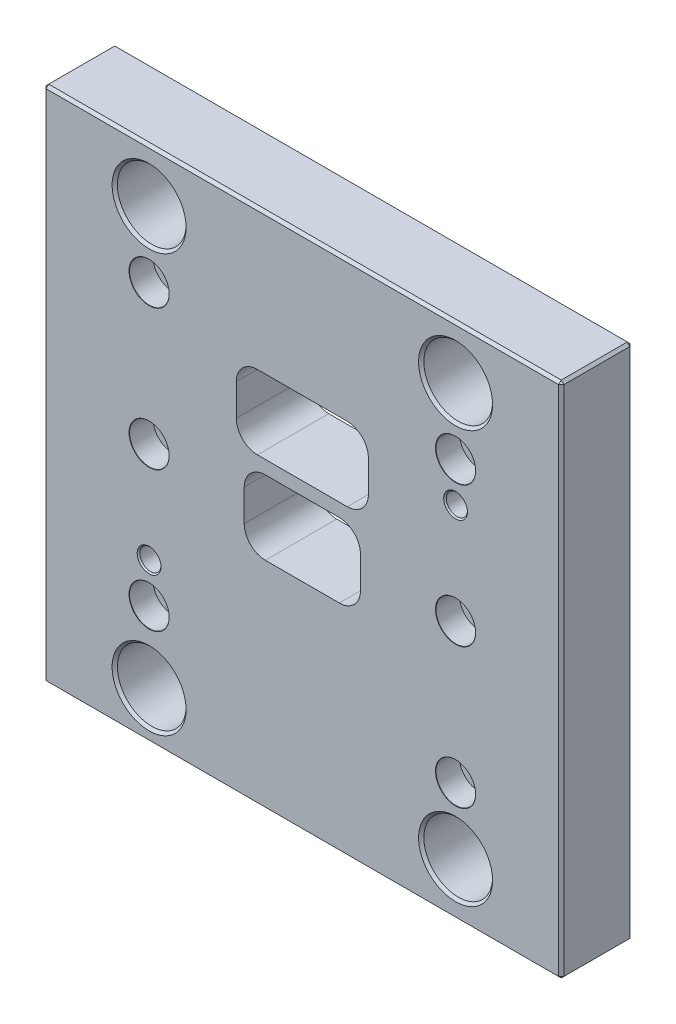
ISO-10303-21;
HEADER;
FILE_DESCRIPTION(('STEP AP214'),'2;1');
FILE_NAME('part.step','',(''),(''),'','','');
FILE_SCHEMA(('AUTOMOTIVE_DESIGN { 1 0 10303 214 1 1 1 1 }'));
ENDSEC;
DATA;
#1=APPLICATION_CONTEXT('core data for automotive mechanical design processes');
#2=APPLICATION_PROTOCOL_DEFINITION('international standard','automotive_design',2000,#1);
#3=PRODUCT_CONTEXT('',#1,'mechanical');
#4=PRODUCT('Part','Part','',(#3));
#5=PRODUCT_RELATED_PRODUCT_CATEGORY('part','',(#4));
#6=PRODUCT_DEFINITION_FORMATION('','',#4);
#7=PRODUCT_DEFINITION_CONTEXT('part definition',#1,'design');
#8=PRODUCT_DEFINITION('design','',#6,#7);
#9=PRODUCT_DEFINITION_SHAPE('','',#8);
#10=(LENGTH_UNIT() NAMED_UNIT(*) SI_UNIT(.MILLI.,.METRE.));
#11=(NAMED_UNIT(*) PLANE_ANGLE_UNIT() SI_UNIT($,.RADIAN.));
#12=(NAMED_UNIT(*) SI_UNIT($,.STERADIAN.) SOLID_ANGLE_UNIT());
#13=UNCERTAINTY_MEASURE_WITH_UNIT(LENGTH_MEASURE(1.E-05),#10,'distance_accuracy_value','');
#14=(GEOMETRIC_REPRESENTATION_CONTEXT(3) GLOBAL_UNCERTAINTY_ASSIGNED_CONTEXT((#13)) GLOBAL_UNIT_ASSIGNED_CONTEXT((#10,
#11,#12)) REPRESENTATION_CONTEXT('',''));
#15=CARTESIAN_POINT('',(0.,0.,0.));
#16=DIRECTION('',(0.,0.,1.));
#17=DIRECTION('',(1.,0.,0.));
#18=AXIS2_PLACEMENT_3D('',#15,#16,#17);
#19=CARTESIAN_POINT('',(0.499999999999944,195.5,26.));
#20=DIRECTION('',(-0.577350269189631,0.577350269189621,0.577350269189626));
#21=DIRECTION('',(0.707106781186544,0.,0.70710678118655));
#22=AXIS2_PLACEMENT_3D('',#19,#20,#21);
#23=PLANE('',#22);
#24=DIRECTION('',(0.,-0.707106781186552,0.707106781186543));
#25=VECTOR('',#24,1.);
#26=CARTESIAN_POINT('',(0.999999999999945,195.5,26.5));
#27=LINE('',#26,#25);
#28=CARTESIAN_POINT('',(0.999999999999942,196.,26.));
#29=VERTEX_POINT('',#28);
#30=CARTESIAN_POINT('',(0.999999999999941,195.,27.));
#31=VERTEX_POINT('',#30);
#32=EDGE_CURVE('E267',#29,#31,#27,.T.);
#33=ORIENTED_EDGE('',*,*,#32,.F.);
#34=DIRECTION('',(-0.707106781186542,-0.707106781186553,0.));
#35=VECTOR('',#34,1.);
#36=CARTESIAN_POINT('',(0.499999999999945,195.5,26.));
#37=LINE('',#36,#35);
#38=CARTESIAN_POINT('',(0.,195.,26.));
#39=VERTEX_POINT('',#38);
#40=EDGE_CURVE('E273',#39,#29,#37,.F.);
#41=ORIENTED_EDGE('',*,*,#40,.F.);
#42=DIRECTION('',(0.707106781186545,0.,0.707106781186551));
#43=VECTOR('',#42,1.);
#44=CARTESIAN_POINT('',(0.499999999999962,195.,26.5));
#45=LINE('',#44,#43);
#46=EDGE_CURVE('E264',#31,#39,#45,.F.);
#47=ORIENTED_EDGE('',*,*,#46,.F.);
#48=EDGE_LOOP('',(#33,#41,#47));
#49=FACE_BOUND('',#48,.T.);
#50=ADVANCED_FACE('F17',(#49),#23,.T.);
#51=CARTESIAN_POINT('',(0.500000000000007,0.499999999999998,26.));
#52=DIRECTION('',(-0.577350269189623,-0.577350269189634,0.577350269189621));
#53=DIRECTION('',(0.707106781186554,-0.707106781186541,0.));
#54=AXIS2_PLACEMENT_3D('',#51,#52,#53);
#55=PLANE('',#54);
#56=DIRECTION('',(0.707106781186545,0.,0.707106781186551));
#57=VECTOR('',#56,1.);
#58=CARTESIAN_POINT('',(0.499999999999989,0.999999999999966,26.5));
#59=LINE('',#58,#57);
#60=CARTESIAN_POINT('',(0.,0.999999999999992,26.));
#61=VERTEX_POINT('',#60);
#62=CARTESIAN_POINT('',(0.999999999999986,0.999999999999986,27.));
#63=VERTEX_POINT('',#62);
#64=EDGE_CURVE('E261',#61,#63,#59,.T.);
#65=ORIENTED_EDGE('',*,*,#64,.F.);
#66=DIRECTION('',(0.707106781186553,-0.707106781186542,0.));
#67=VECTOR('',#66,1.);
#68=CARTESIAN_POINT('',(0.500000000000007,0.5,26.));
#69=LINE('',#68,#67);
#70=CARTESIAN_POINT('',(1.00000000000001,0.,26.));
#71=VERTEX_POINT('',#70);
#72=EDGE_CURVE('E291',#71,#61,#69,.F.);
#73=ORIENTED_EDGE('',*,*,#72,.F.);
#74=DIRECTION('',(0.,-0.707106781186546,-0.707106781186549));
#75=VECTOR('',#74,1.);
#76=CARTESIAN_POINT('',(1.,0.499999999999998,26.5));
#77=LINE('',#76,#75);
#78=EDGE_CURVE('E258',#63,#71,#77,.T.);
#79=ORIENTED_EDGE('',*,*,#78,.F.);
#80=EDGE_LOOP('',(#65,#73,#79));
#81=FACE_BOUND('',#80,.T.);
#82=ADVANCED_FACE('F1204',(#81),#55,.T.);
#83=CARTESIAN_POINT('',(195.5,0.500000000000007,26.));
#84=DIRECTION('',(0.577350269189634,-0.577350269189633,0.57735026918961));
#85=DIRECTION('',(0.707106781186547,0.707106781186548,0.));
#86=AXIS2_PLACEMENT_3D('',#83,#84,#85);
#87=PLANE('',#86);
#88=DIRECTION('',(0.70710678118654,0.,-0.707106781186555));
#89=VECTOR('',#88,1.);
#90=CARTESIAN_POINT('',(195.5,1.,26.5));
#91=LINE('',#90,#89);
#92=CARTESIAN_POINT('',(195.,0.999999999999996,27.));
#93=VERTEX_POINT('',#92);
#94=CARTESIAN_POINT('',(196.,1.00000000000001,26.));
#95=VERTEX_POINT('',#94);
#96=EDGE_CURVE('E252',#93,#95,#91,.T.);
#97=ORIENTED_EDGE('',*,*,#96,.F.);
#98=DIRECTION('',(0.,-0.707106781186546,-0.707106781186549));
#99=VECTOR('',#98,1.);
#100=CARTESIAN_POINT('',(195.,0.499999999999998,26.5));
#101=LINE('',#100,#99);
#102=CARTESIAN_POINT('',(195.,0.,26.));
#103=VERTEX_POINT('',#102);
#104=EDGE_CURVE('E255',#103,#93,#101,.F.);
#105=ORIENTED_EDGE('',*,*,#104,.F.);
#106=DIRECTION('',(0.707106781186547,0.707106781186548,0.));
#107=VECTOR('',#106,1.);
#108=CARTESIAN_POINT('',(195.5,0.500000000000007,26.));
#109=LINE('',#108,#107);
#110=EDGE_CURVE('E285',#95,#103,#109,.F.);
#111=ORIENTED_EDGE('',*,*,#110,.F.);
#112=EDGE_LOOP('',(#97,#105,#111));
#113=FACE_BOUND('',#112,.T.);
#114=ADVANCED_FACE('F1196',(#113),#87,.T.);
#115=CARTESIAN_POINT('',(195.5,195.5,26.));
#116=DIRECTION('',(0.57735026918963,0.57735026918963,0.577350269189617));
#117=DIRECTION('',(-0.707106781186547,0.707106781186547,0.));
#118=AXIS2_PLACEMENT_3D('',#115,#116,#117);
#119=PLANE('',#118);
#120=DIRECTION('',(0.,-0.707106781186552,0.707106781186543));
#121=VECTOR('',#120,1.);
#122=CARTESIAN_POINT('',(195.,195.5,26.5));
#123=LINE('',#122,#121);
#124=CARTESIAN_POINT('',(195.,195.,27.));
#125=VERTEX_POINT('',#124);
#126=CARTESIAN_POINT('',(195.,196.,26.));
#127=VERTEX_POINT('',#126);
#128=EDGE_CURVE('E270',#125,#127,#123,.F.);
#129=ORIENTED_EDGE('',*,*,#128,.F.);
#130=DIRECTION('',(0.70710678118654,0.,-0.707106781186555));
#131=VECTOR('',#130,1.);
#132=CARTESIAN_POINT('',(195.5,195.,26.5));
#133=LINE('',#132,#131);
#134=CARTESIAN_POINT('',(196.,195.,26.));
#135=VERTEX_POINT('',#134);
#136=EDGE_CURVE('E247',#135,#125,#133,.F.);
#137=ORIENTED_EDGE('',*,*,#136,.F.);
#138=DIRECTION('',(-0.707106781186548,0.707106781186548,0.));
#139=VECTOR('',#138,1.);
#140=CARTESIAN_POINT('',(195.5,195.5,26.));
#141=LINE('',#140,#139);
#142=EDGE_CURVE('E279',#127,#135,#141,.F.);
#143=ORIENTED_EDGE('',*,*,#142,.F.);
#144=EDGE_LOOP('',(#129,#137,#143));
#145=FACE_BOUND('',#144,.T.);
#146=ADVANCED_FACE('F1188',(#145),#119,.T.);
#147=CARTESIAN_POINT('',(156.,45.,22.5));
#148=DIRECTION('',(0.,0.,1.));
#149=DIRECTION('',(1.,0.,0.));
#150=AXIS2_PLACEMENT_3D('',#147,#148,#149);
#151=CYLINDRICAL_SURFACE('',#150,7.5);
#152=CARTESIAN_POINT('',(156.,45.,26.8999999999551));
#153=DIRECTION('',(0.,0.,1.));
#154=DIRECTION('',(-1.,0.,0.));
#155=AXIS2_PLACEMENT_3D('',#152,#153,#154);
#156=CIRCLE('',#155,7.50000000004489);
#157=CARTESIAN_POINT('',(148.499999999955,45.,26.8999999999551));
#158=VERTEX_POINT('',#157);
#159=EDGE_CURVE('E242',#158,#158,#156,.T.);
#160=ORIENTED_EDGE('',*,*,#159,.T.);
#161=EDGE_LOOP('',(#160));
#162=FACE_BOUND('',#161,.T.);
#163=CARTESIAN_POINT('',(156.,45.,18.));
#164=DIRECTION('',(0.,0.,1.));
#165=DIRECTION('',(1.,0.,0.));
#166=AXIS2_PLACEMENT_3D('',#163,#164,#165);
#167=CIRCLE('',#166,7.5);
#168=CARTESIAN_POINT('',(163.5,45.,18.));
#169=VERTEX_POINT('',#168);
#170=EDGE_CURVE('E293',#169,#169,#167,.T.);
#171=ORIENTED_EDGE('',*,*,#170,.F.);
#172=EDGE_LOOP('',(#171));
#173=FACE_BOUND('',#172,.T.);
#174=ADVANCED_FACE('F462',(#162,#173),#151,.F.);
#175=CARTESIAN_POINT('',(40.,151.,22.5));
#176=DIRECTION('',(0.,0.,1.));
#177=DIRECTION('',(1.,0.,0.));
#178=AXIS2_PLACEMENT_3D('',#175,#176,#177);
#179=CYLINDRICAL_SURFACE('',#178,7.5);
#180=CARTESIAN_POINT('',(40.,151.,26.8999999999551));
#181=DIRECTION('',(0.,0.,1.));
#182=DIRECTION('',(-1.,0.,0.));
#183=AXIS2_PLACEMENT_3D('',#180,#181,#182);
#184=CIRCLE('',#183,7.50000000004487);
#185=CARTESIAN_POINT('',(32.4999999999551,151.,26.8999999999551));
#186=VERTEX_POINT('',#185);
#187=EDGE_CURVE('E237',#186,#186,#184,.T.);
#188=ORIENTED_EDGE('',*,*,#187,.T.);
#189=EDGE_LOOP('',(#188));
#190=FACE_BOUND('',#189,.T.);
#191=CARTESIAN_POINT('',(40.,151.,18.));
#192=DIRECTION('',(0.,0.,1.));
#193=DIRECTION('',(1.,0.,0.));
#194=AXIS2_PLACEMENT_3D('',#191,#192,#193);
#195=CIRCLE('',#194,7.5);
#196=CARTESIAN_POINT('',(47.5,151.,18.));
#197=VERTEX_POINT('',#196);
#198=EDGE_CURVE('E439',#197,#197,#195,.T.);
#199=ORIENTED_EDGE('',*,*,#198,.F.);
#200=EDGE_LOOP('',(#199));
#201=FACE_BOUND('',#200,.T.);
#202=ADVANCED_FACE('F451',(#190,#201),#179,.F.);
#203=CARTESIAN_POINT('',(40.,45.,22.5));
#204=DIRECTION('',(0.,0.,1.));
#205=DIRECTION('',(1.,0.,0.));
#206=AXIS2_PLACEMENT_3D('',#203,#204,#205);
#207=CYLINDRICAL_SURFACE('',#206,7.5);
#208=CARTESIAN_POINT('',(40.,45.,26.8999999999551));
#209=DIRECTION('',(0.,0.,1.));
#210=DIRECTION('',(-1.,0.,0.));
#211=AXIS2_PLACEMENT_3D('',#208,#209,#210);
#212=CIRCLE('',#211,7.50000000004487);
#213=CARTESIAN_POINT('',(32.4999999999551,45.,26.8999999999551));
#214=VERTEX_POINT('',#213);
#215=EDGE_CURVE('E232',#214,#214,#212,.T.);
#216=ORIENTED_EDGE('',*,*,#215,.T.);
#217=EDGE_LOOP('',(#216));
#218=FACE_BOUND('',#217,.T.);
#219=CARTESIAN_POINT('',(40.,45.,18.));
#220=DIRECTION('',(0.,0.,1.));
#221=DIRECTION('',(1.,0.,0.));
#222=AXIS2_PLACEMENT_3D('',#219,#220,#221);
#223=CIRCLE('',#222,7.5);
#224=CARTESIAN_POINT('',(47.5,45.,18.));
#225=VERTEX_POINT('',#224);
#226=EDGE_CURVE('E20',#225,#225,#223,.T.);
#227=ORIENTED_EDGE('',*,*,#226,.F.);
#228=EDGE_LOOP('',(#227));
#229=FACE_BOUND('',#228,.T.);
#230=ADVANCED_FACE('F448',(#218,#229),#207,.F.);
#231=CARTESIAN_POINT('',(40.,98.,22.5));
#232=DIRECTION('',(0.,0.,1.));
#233=DIRECTION('',(1.,0.,0.));
#234=AXIS2_PLACEMENT_3D('',#231,#232,#233);
#235=CYLINDRICAL_SURFACE('',#234,7.5);
#236=CARTESIAN_POINT('',(40.,98.,26.8999999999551));
#237=DIRECTION('',(0.,0.,1.));
#238=DIRECTION('',(-1.,0.,0.));
#239=AXIS2_PLACEMENT_3D('',#236,#237,#238);
#240=CIRCLE('',#239,7.50000000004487);
#241=CARTESIAN_POINT('',(32.4999999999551,98.,26.8999999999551));
#242=VERTEX_POINT('',#241);
#243=EDGE_CURVE('E227',#242,#242,#240,.T.);
#244=ORIENTED_EDGE('',*,*,#243,.T.);
#245=EDGE_LOOP('',(#244));
#246=FACE_BOUND('',#245,.T.);
#247=CARTESIAN_POINT('',(40.,98.,18.));
#248=DIRECTION('',(0.,0.,1.));
#249=DIRECTION('',(1.,0.,0.));
#250=AXIS2_PLACEMENT_3D('',#247,#248,#249);
#251=CIRCLE('',#250,7.5);
#252=CARTESIAN_POINT('',(47.5,98.,18.));
#253=VERTEX_POINT('',#252);
#254=EDGE_CURVE('E437',#253,#253,#251,.T.);
#255=ORIENTED_EDGE('',*,*,#254,.F.);
#256=EDGE_LOOP('',(#255));
#257=FACE_BOUND('',#256,.T.);
#258=ADVANCED_FACE('F450',(#246,#257),#235,.F.);
#259=CARTESIAN_POINT('',(156.,98.,22.5));
#260=DIRECTION('',(0.,0.,1.));
#261=DIRECTION('',(1.,0.,0.));
#262=AXIS2_PLACEMENT_3D('',#259,#260,#261);
#263=CYLINDRICAL_SURFACE('',#262,7.5);
#264=CARTESIAN_POINT('',(156.,98.,26.8999999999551));
#265=DIRECTION('',(0.,0.,1.));
#266=DIRECTION('',(-1.,0.,0.));
#267=AXIS2_PLACEMENT_3D('',#264,#265,#266);
#268=CIRCLE('',#267,7.50000000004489);
#269=CARTESIAN_POINT('',(148.499999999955,98.,26.8999999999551));
#270=VERTEX_POINT('',#269);
#271=EDGE_CURVE('E222',#270,#270,#268,.T.);
#272=ORIENTED_EDGE('',*,*,#271,.T.);
#273=EDGE_LOOP('',(#272));
#274=FACE_BOUND('',#273,.T.);
#275=CARTESIAN_POINT('',(156.,98.,18.));
#276=DIRECTION('',(0.,0.,1.));
#277=DIRECTION('',(1.,0.,0.));
#278=AXIS2_PLACEMENT_3D('',#275,#276,#277);
#279=CIRCLE('',#278,7.5);
#280=CARTESIAN_POINT('',(163.5,98.,18.));
#281=VERTEX_POINT('',#280);
#282=EDGE_CURVE('E434',#281,#281,#279,.T.);
#283=ORIENTED_EDGE('',*,*,#282,.F.);
#284=EDGE_LOOP('',(#283));
#285=FACE_BOUND('',#284,.T.);
#286=ADVANCED_FACE('F459',(#274,#285),#263,.F.);
#287=CARTESIAN_POINT('',(156.,151.,22.5));
#288=DIRECTION('',(0.,0.,1.));
#289=DIRECTION('',(1.,0.,0.));
#290=AXIS2_PLACEMENT_3D('',#287,#288,#289);
#291=CYLINDRICAL_SURFACE('',#290,7.5);
#292=CARTESIAN_POINT('',(156.,151.,26.8999999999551));
#293=DIRECTION('',(0.,0.,1.));
#294=DIRECTION('',(-1.,0.,0.));
#295=AXIS2_PLACEMENT_3D('',#292,#293,#294);
#296=CIRCLE('',#295,7.50000000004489);
#297=CARTESIAN_POINT('',(148.499999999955,151.,26.8999999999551));
#298=VERTEX_POINT('',#297);
#299=EDGE_CURVE('E218',#298,#298,#296,.T.);
#300=ORIENTED_EDGE('',*,*,#299,.T.);
#301=EDGE_LOOP('',(#300));
#302=FACE_BOUND('',#301,.T.);
#303=CARTESIAN_POINT('',(156.,151.,18.));
#304=DIRECTION('',(0.,0.,1.));
#305=DIRECTION('',(1.,0.,0.));
#306=AXIS2_PLACEMENT_3D('',#303,#304,#305);
#307=CIRCLE('',#306,7.5);
#308=CARTESIAN_POINT('',(163.5,151.,18.));
#309=VERTEX_POINT('',#308);
#310=EDGE_CURVE('E431',#309,#309,#307,.T.);
#311=ORIENTED_EDGE('',*,*,#310,.F.);
#312=EDGE_LOOP('',(#311));
#313=FACE_BOUND('',#312,.T.);
#314=ADVANCED_FACE('F806',(#302,#313),#291,.F.);
#315=CARTESIAN_POINT('',(40.,45.,18.));
#316=DIRECTION('',(0.,0.,1.));
#317=DIRECTION('',(1.,0.,0.));
#318=AXIS2_PLACEMENT_3D('',#315,#316,#317);
#319=PLANE('',#318);
#320=CARTESIAN_POINT('',(40.,45.,18.0000000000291));
#321=DIRECTION('',(0.,0.,1.));
#322=DIRECTION('',(1.,0.,0.));
#323=AXIS2_PLACEMENT_3D('',#320,#321,#322);
#324=CIRCLE('',#323,4.59999999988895);
#325=CARTESIAN_POINT('',(44.599999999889,45.,18.0000000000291));
#326=VERTEX_POINT('',#325);
#327=EDGE_CURVE('E221',#326,#326,#324,.F.);
#328=ORIENTED_EDGE('',*,*,#327,.T.);
#329=EDGE_LOOP('',(#328));
#330=FACE_BOUND('',#329,.T.);
#331=ORIENTED_EDGE('',*,*,#226,.T.);
#332=EDGE_LOOP('',(#331));
#333=FACE_BOUND('',#332,.T.);
#334=ADVANCED_FACE('F446',(#330,#333),#319,.T.);
#335=CARTESIAN_POINT('',(40.,151.,18.));
#336=DIRECTION('',(0.,0.,1.));
#337=DIRECTION('',(1.,0.,0.));
#338=AXIS2_PLACEMENT_3D('',#335,#336,#337);
#339=PLANE('',#338);
#340=CARTESIAN_POINT('',(40.,151.,18.0000000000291));
#341=DIRECTION('',(0.,0.,1.));
#342=DIRECTION('',(1.,0.,0.));
#343=AXIS2_PLACEMENT_3D('',#340,#341,#342);
#344=CIRCLE('',#343,4.59999999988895);
#345=CARTESIAN_POINT('',(44.599999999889,151.,18.0000000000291));
#346=VERTEX_POINT('',#345);
#347=EDGE_CURVE('E424',#346,#346,#344,.F.);
#348=ORIENTED_EDGE('',*,*,#347,.T.);
#349=EDGE_LOOP('',(#348));
#350=FACE_BOUND('',#349,.T.);
#351=ORIENTED_EDGE('',*,*,#198,.T.);
#352=EDGE_LOOP('',(#351));
#353=FACE_BOUND('',#352,.T.);
#354=ADVANCED_FACE('F799',(#350,#353),#339,.T.);
#355=CARTESIAN_POINT('',(40.,98.,18.));
#356=DIRECTION('',(0.,0.,1.));
#357=DIRECTION('',(1.,0.,0.));
#358=AXIS2_PLACEMENT_3D('',#355,#356,#357);
#359=PLANE('',#358);
#360=CARTESIAN_POINT('',(40.,98.,18.0000000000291));
#361=DIRECTION('',(0.,0.,1.));
#362=DIRECTION('',(1.,0.,0.));
#363=AXIS2_PLACEMENT_3D('',#360,#361,#362);
#364=CIRCLE('',#363,4.59999999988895);
#365=CARTESIAN_POINT('',(44.599999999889,98.,18.0000000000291));
#366=VERTEX_POINT('',#365);
#367=EDGE_CURVE('E421',#366,#366,#364,.F.);
#368=ORIENTED_EDGE('',*,*,#367,.T.);
#369=EDGE_LOOP('',(#368));
#370=FACE_BOUND('',#369,.T.);
#371=ORIENTED_EDGE('',*,*,#254,.T.);
#372=EDGE_LOOP('',(#371));
#373=FACE_BOUND('',#372,.T.);
#374=ADVANCED_FACE('F795',(#370,#373),#359,.T.);
#375=CARTESIAN_POINT('',(156.,98.,18.));
#376=DIRECTION('',(0.,0.,1.));
#377=DIRECTION('',(1.,0.,0.));
#378=AXIS2_PLACEMENT_3D('',#375,#376,#377);
#379=PLANE('',#378);
#380=CARTESIAN_POINT('',(156.,98.,18.0000000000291));
#381=DIRECTION('',(0.,0.,1.));
#382=DIRECTION('',(1.,0.,0.));
#383=AXIS2_PLACEMENT_3D('',#380,#381,#382);
#384=CIRCLE('',#383,4.59999999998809);
#385=CARTESIAN_POINT('',(160.599999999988,98.,18.0000000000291));
#386=VERTEX_POINT('',#385);
#387=EDGE_CURVE('E418',#386,#386,#384,.F.);
#388=ORIENTED_EDGE('',*,*,#387,.T.);
#389=EDGE_LOOP('',(#388));
#390=FACE_BOUND('',#389,.T.);
#391=ORIENTED_EDGE('',*,*,#282,.T.);
#392=EDGE_LOOP('',(#391));
#393=FACE_BOUND('',#392,.T.);
#394=ADVANCED_FACE('F791',(#390,#393),#379,.T.);
#395=CARTESIAN_POINT('',(156.,151.,18.));
#396=DIRECTION('',(0.,0.,1.));
#397=DIRECTION('',(1.,0.,0.));
#398=AXIS2_PLACEMENT_3D('',#395,#396,#397);
#399=PLANE('',#398);
#400=CARTESIAN_POINT('',(156.,151.,18.0000000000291));
#401=DIRECTION('',(0.,0.,1.));
#402=DIRECTION('',(1.,0.,0.));
#403=AXIS2_PLACEMENT_3D('',#400,#401,#402);
#404=CIRCLE('',#403,4.59999999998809);
#405=CARTESIAN_POINT('',(160.599999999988,151.,18.0000000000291));
#406=VERTEX_POINT('',#405);
#407=EDGE_CURVE('E415',#406,#406,#404,.F.);
#408=ORIENTED_EDGE('',*,*,#407,.T.);
#409=EDGE_LOOP('',(#408));
#410=FACE_BOUND('',#409,.T.);
#411=ORIENTED_EDGE('',*,*,#310,.T.);
#412=EDGE_LOOP('',(#411));
#413=FACE_BOUND('',#412,.T.);
#414=ADVANCED_FACE('F787',(#410,#413),#399,.T.);
#415=CARTESIAN_POINT('',(156.,45.,18.));
#416=DIRECTION('',(0.,0.,1.));
#417=DIRECTION('',(1.,0.,0.));
#418=AXIS2_PLACEMENT_3D('',#415,#416,#417);
#419=PLANE('',#418);
#420=CARTESIAN_POINT('',(156.,45.,18.0000000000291));
#421=DIRECTION('',(0.,0.,1.));
#422=DIRECTION('',(1.,0.,0.));
#423=AXIS2_PLACEMENT_3D('',#420,#421,#422);
#424=CIRCLE('',#423,4.59999999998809);
#425=CARTESIAN_POINT('',(160.599999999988,45.,18.0000000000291));
#426=VERTEX_POINT('',#425);
#427=EDGE_CURVE('E217',#426,#426,#424,.F.);
#428=ORIENTED_EDGE('',*,*,#427,.T.);
#429=EDGE_LOOP('',(#428));
#430=FACE_BOUND('',#429,.T.);
#431=ORIENTED_EDGE('',*,*,#170,.T.);
#432=EDGE_LOOP('',(#431));
#433=FACE_BOUND('',#432,.T.);
#434=ADVANCED_FACE('F783',(#430,#433),#419,.T.);
#435=CARTESIAN_POINT('',(0.500000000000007,0.5,0.));
#436=DIRECTION('',(-0.707106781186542,-0.707106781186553,0.));
#437=DIRECTION('',(0.707106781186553,-0.707106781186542,0.));
#438=AXIS2_PLACEMENT_3D('',#435,#436,#437);
#439=PLANE('',#438);
#440=DIRECTION('',(0.707106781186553,-0.707106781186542,0.));
#441=VECTOR('',#440,1.);
#442=CARTESIAN_POINT('',(0.500000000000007,0.5,1.));
#443=LINE('',#442,#441);
#444=CARTESIAN_POINT('',(0.,0.999999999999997,1.));
#445=VERTEX_POINT('',#444);
#446=CARTESIAN_POINT('',(1.00000000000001,0.,1.));
#447=VERTEX_POINT('',#446);
#448=EDGE_CURVE('E288',#445,#447,#443,.T.);
#449=ORIENTED_EDGE('',*,*,#448,.T.);
#450=DIRECTION('',(0.,0.,-1.));
#451=VECTOR('',#450,1.);
#452=CARTESIAN_POINT('',(1.,0.,0.));
#453=LINE('',#452,#451);
#454=EDGE_CURVE('E205',#71,#447,#453,.T.);
#455=ORIENTED_EDGE('',*,*,#454,.F.);
#456=ORIENTED_EDGE('',*,*,#72,.T.);
#457=DIRECTION('',(0.,0.,1.));
#458=VECTOR('',#457,1.);
#459=CARTESIAN_POINT('',(0.,0.999999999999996,0.));
#460=LINE('',#459,#458);
#461=EDGE_CURVE('E211',#445,#61,#460,.T.);
#462=ORIENTED_EDGE('',*,*,#461,.F.);
#463=EDGE_LOOP('',(#449,#455,#456,#462));
#464=FACE_BOUND('',#463,.T.);
#465=ADVANCED_FACE('F779',(#464),#439,.T.);
#466=CARTESIAN_POINT('',(195.5,0.500000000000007,0.));
#467=DIRECTION('',(0.707106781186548,-0.707106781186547,0.));
#468=DIRECTION('',(0.707106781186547,0.707106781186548,0.));
#469=AXIS2_PLACEMENT_3D('',#466,#467,#468);
#470=PLANE('',#469);
#471=DIRECTION('',(0.707106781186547,0.707106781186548,0.));
#472=VECTOR('',#471,1.);
#473=CARTESIAN_POINT('',(195.5,0.500000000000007,1.));
#474=LINE('',#473,#472);
#475=CARTESIAN_POINT('',(195.,0.,0.999999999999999));
#476=VERTEX_POINT('',#475);
#477=CARTESIAN_POINT('',(196.,1.00000000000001,0.999999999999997));
#478=VERTEX_POINT('',#477);
#479=EDGE_CURVE('E282',#476,#478,#474,.T.);
#480=ORIENTED_EDGE('',*,*,#479,.T.);
#481=DIRECTION('',(0.,0.,-1.));
#482=VECTOR('',#481,1.);
#483=CARTESIAN_POINT('',(196.,1.,0.));
#484=LINE('',#483,#482);
#485=EDGE_CURVE('E190',#95,#478,#484,.T.);
#486=ORIENTED_EDGE('',*,*,#485,.F.);
#487=ORIENTED_EDGE('',*,*,#110,.T.);
#488=DIRECTION('',(0.,0.,-1.));
#489=VECTOR('',#488,1.);
#490=CARTESIAN_POINT('',(195.,0.,0.));
#491=LINE('',#490,#489);
#492=EDGE_CURVE('E202',#476,#103,#491,.F.);
#493=ORIENTED_EDGE('',*,*,#492,.F.);
#494=EDGE_LOOP('',(#480,#486,#487,#493));
#495=FACE_BOUND('',#494,.T.);
#496=ADVANCED_FACE('F775',(#495),#470,.T.);
#497=CARTESIAN_POINT('',(195.5,195.5,0.));
#498=DIRECTION('',(0.707106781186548,0.707106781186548,0.));
#499=DIRECTION('',(-0.707106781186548,0.707106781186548,0.));
#500=AXIS2_PLACEMENT_3D('',#497,#498,#499);
#501=PLANE('',#500);
#502=DIRECTION('',(-0.707106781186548,0.707106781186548,0.));
#503=VECTOR('',#502,1.);
#504=CARTESIAN_POINT('',(195.5,195.5,1.));
#505=LINE('',#504,#503);
#506=CARTESIAN_POINT('',(196.,195.,0.999999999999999));
#507=VERTEX_POINT('',#506);
#508=CARTESIAN_POINT('',(195.,196.,1.));
#509=VERTEX_POINT('',#508);
#510=EDGE_CURVE('E276',#507,#509,#505,.T.);
#511=ORIENTED_EDGE('',*,*,#510,.T.);
#512=DIRECTION('',(0.,0.,1.));
#513=VECTOR('',#512,1.);
#514=CARTESIAN_POINT('',(195.,196.,0.));
#515=LINE('',#514,#513);
#516=EDGE_CURVE('E181',#127,#509,#515,.F.);
#517=ORIENTED_EDGE('',*,*,#516,.F.);
#518=ORIENTED_EDGE('',*,*,#142,.T.);
#519=DIRECTION('',(0.,0.,-1.));
#520=VECTOR('',#519,1.);
#521=CARTESIAN_POINT('',(196.,195.,0.));
#522=LINE('',#521,#520);
#523=EDGE_CURVE('E196',#507,#135,#522,.F.);
#524=ORIENTED_EDGE('',*,*,#523,.F.);
#525=EDGE_LOOP('',(#511,#517,#518,#524));
#526=FACE_BOUND('',#525,.T.);
#527=ADVANCED_FACE('F771',(#526),#501,.T.);
#528=CARTESIAN_POINT('',(0.499999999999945,195.5,0.));
#529=DIRECTION('',(-0.707106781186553,0.707106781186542,0.));
#530=DIRECTION('',(-0.707106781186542,-0.707106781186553,0.));
#531=AXIS2_PLACEMENT_3D('',#528,#529,#530);
#532=PLANE('',#531);
#533=DIRECTION('',(0.707106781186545,0.70710678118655,0.));
#534=VECTOR('',#533,1.);
#535=CARTESIAN_POINT('',(0.,195.,1.));
#536=LINE('',#535,#534);
#537=CARTESIAN_POINT('',(0.,195.,0.999999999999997));
#538=VERTEX_POINT('',#537);
#539=CARTESIAN_POINT('',(0.99999999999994,196.,0.999999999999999));
#540=VERTEX_POINT('',#539);
#541=EDGE_CURVE('E187',#538,#540,#536,.T.);
#542=ORIENTED_EDGE('',*,*,#541,.F.);
#543=DIRECTION('',(0.,0.,1.));
#544=VECTOR('',#543,1.);
#545=CARTESIAN_POINT('',(0.,195.,0.));
#546=LINE('',#545,#544);
#547=EDGE_CURVE('E214',#39,#538,#546,.F.);
#548=ORIENTED_EDGE('',*,*,#547,.F.);
#549=ORIENTED_EDGE('',*,*,#40,.T.);
#550=DIRECTION('',(0.,0.,1.));
#551=VECTOR('',#550,1.);
#552=CARTESIAN_POINT('',(0.999999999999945,196.,0.));
#553=LINE('',#552,#551);
#554=EDGE_CURVE('E177',#540,#29,#553,.T.);
#555=ORIENTED_EDGE('',*,*,#554,.F.);
#556=EDGE_LOOP('',(#542,#548,#549,#555));
#557=FACE_BOUND('',#556,.T.);
#558=ADVANCED_FACE('F767',(#557),#532,.T.);
#559=CARTESIAN_POINT('',(49.,195.5,26.5));
#560=DIRECTION('',(0.,0.707106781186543,0.707106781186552));
#561=DIRECTION('',(0.,-0.707106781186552,0.707106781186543));
#562=AXIS2_PLACEMENT_3D('',#559,#560,#561);
#563=PLANE('',#562);
#564=ORIENTED_EDGE('',*,*,#32,.T.);
#565=DIRECTION('',(1.,0.,0.));
#566=VECTOR('',#565,1.);
#567=CARTESIAN_POINT('',(98.,195.,27.));
#568=LINE('',#567,#566);
#569=EDGE_CURVE('E180',#125,#31,#568,.F.);
#570=ORIENTED_EDGE('',*,*,#569,.F.);
#571=ORIENTED_EDGE('',*,*,#128,.T.);
#572=DIRECTION('',(1.,0.,0.));
#573=VECTOR('',#572,1.);
#574=CARTESIAN_POINT('',(0.,196.,26.));
#575=LINE('',#574,#573);
#576=EDGE_CURVE('E184',#29,#127,#575,.T.);
#577=ORIENTED_EDGE('',*,*,#576,.F.);
#578=EDGE_LOOP('',(#564,#570,#571,#577));
#579=FACE_BOUND('',#578,.T.);
#580=ADVANCED_FACE('F763',(#579),#563,.T.);
#581=CARTESIAN_POINT('',(0.499999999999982,49.,26.5));
#582=DIRECTION('',(-0.707106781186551,0.,0.707106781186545));
#583=DIRECTION('',(0.707106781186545,0.,0.707106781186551));
#584=AXIS2_PLACEMENT_3D('',#581,#582,#583);
#585=PLANE('',#584);
#586=ORIENTED_EDGE('',*,*,#64,.T.);
#587=DIRECTION('',(0.,1.,0.));
#588=VECTOR('',#587,1.);
#589=CARTESIAN_POINT('',(0.999999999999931,98.,27.));
#590=LINE('',#589,#588);
#591=EDGE_CURVE('E1256',#31,#63,#590,.F.);
#592=ORIENTED_EDGE('',*,*,#591,.F.);
#593=ORIENTED_EDGE('',*,*,#46,.T.);
#594=DIRECTION('',(0.,1.,0.));
#595=VECTOR('',#594,1.);
#596=CARTESIAN_POINT('',(0.,0.,26.));
#597=LINE('',#596,#595);
#598=EDGE_CURVE('E208',#61,#39,#597,.T.);
#599=ORIENTED_EDGE('',*,*,#598,.F.);
#600=EDGE_LOOP('',(#586,#592,#593,#599));
#601=FACE_BOUND('',#600,.T.);
#602=ADVANCED_FACE('F759',(#601),#585,.T.);
#603=CARTESIAN_POINT('',(147.,0.499999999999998,26.5));
#604=DIRECTION('',(0.,-0.707106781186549,0.707106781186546));
#605=DIRECTION('',(0.,-0.707106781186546,-0.707106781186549));
#606=AXIS2_PLACEMENT_3D('',#603,#604,#605);
#607=PLANE('',#606);
#608=ORIENTED_EDGE('',*,*,#104,.T.);
#609=DIRECTION('',(1.,0.,0.));
#610=VECTOR('',#609,1.);
#611=CARTESIAN_POINT('',(98.,1.,27.));
#612=LINE('',#611,#610);
#613=EDGE_CURVE('E1253',#63,#93,#612,.T.);
#614=ORIENTED_EDGE('',*,*,#613,.F.);
#615=ORIENTED_EDGE('',*,*,#78,.T.);
#616=DIRECTION('',(1.,0.,0.));
#617=VECTOR('',#616,1.);
#618=CARTESIAN_POINT('',(196.,0.,26.));
#619=LINE('',#618,#617);
#620=EDGE_CURVE('E199',#103,#71,#619,.F.);
#621=ORIENTED_EDGE('',*,*,#620,.F.);
#622=EDGE_LOOP('',(#608,#614,#615,#621));
#623=FACE_BOUND('',#622,.T.);
#624=ADVANCED_FACE('F755',(#623),#607,.T.);
#625=CARTESIAN_POINT('',(195.5,147.,26.5));
#626=DIRECTION('',(0.707106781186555,0.,0.70710678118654));
#627=DIRECTION('',(0.70710678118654,0.,-0.707106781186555));
#628=AXIS2_PLACEMENT_3D('',#625,#626,#627);
#629=PLANE('',#628);
#630=ORIENTED_EDGE('',*,*,#136,.T.);
#631=DIRECTION('',(0.,1.,0.));
#632=VECTOR('',#631,1.);
#633=CARTESIAN_POINT('',(195.,98.,27.));
#634=LINE('',#633,#632);
#635=EDGE_CURVE('E412',#93,#125,#634,.T.);
#636=ORIENTED_EDGE('',*,*,#635,.F.);
#637=ORIENTED_EDGE('',*,*,#96,.T.);
#638=DIRECTION('',(0.,1.,0.));
#639=VECTOR('',#638,1.);
#640=CARTESIAN_POINT('',(196.,196.,26.));
#641=LINE('',#640,#639);
#642=EDGE_CURVE('E193',#135,#95,#641,.F.);
#643=ORIENTED_EDGE('',*,*,#642,.F.);
#644=EDGE_LOOP('',(#630,#636,#637,#643));
#645=FACE_BOUND('',#644,.T.);
#646=ADVANCED_FACE('F751',(#645),#629,.T.);
#647=CARTESIAN_POINT('',(156.,45.,27.0000000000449));
#648=DIRECTION('',(0.,0.,1.));
#649=DIRECTION('',(0.,-1.,0.));
#650=AXIS2_PLACEMENT_3D('',#647,#648,#649);
#651=CONICAL_SURFACE('',#650,7.59999999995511,0.785398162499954);
#652=CARTESIAN_POINT('',(156.,45.,27.0000000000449));
#653=DIRECTION('',(0.,0.,1.));
#654=DIRECTION('',(0.,-1.,0.));
#655=AXIS2_PLACEMENT_3D('',#652,#653,#654);
#656=CIRCLE('',#655,7.59999999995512);
#657=CARTESIAN_POINT('',(156.,37.4000000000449,27.0000000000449));
#658=VERTEX_POINT('',#657);
#659=EDGE_CURVE('E409',#658,#658,#656,.F.);
#660=ORIENTED_EDGE('',*,*,#659,.F.);
#661=EDGE_LOOP('',(#660));
#662=FACE_BOUND('',#661,.T.);
#663=ORIENTED_EDGE('',*,*,#159,.F.);
#664=EDGE_LOOP('',(#663));
#665=FACE_BOUND('',#664,.T.);
#666=ADVANCED_FACE('F747',(#662,#665),#651,.F.);
#667=CARTESIAN_POINT('',(40.,151.,27.0000000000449));
#668=DIRECTION('',(0.,0.,1.));
#669=DIRECTION('',(1.,0.,0.));
#670=AXIS2_PLACEMENT_3D('',#667,#668,#669);
#671=CONICAL_SURFACE('',#670,7.59999999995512,0.785398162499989);
#672=CARTESIAN_POINT('',(40.,151.,27.0000000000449));
#673=DIRECTION('',(0.,0.,1.));
#674=DIRECTION('',(1.,0.,0.));
#675=AXIS2_PLACEMENT_3D('',#672,#673,#674);
#676=CIRCLE('',#675,7.59999999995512);
#677=CARTESIAN_POINT('',(47.5999999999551,151.,27.0000000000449));
#678=VERTEX_POINT('',#677);
#679=EDGE_CURVE('E406',#678,#678,#676,.F.);
#680=ORIENTED_EDGE('',*,*,#679,.F.);
#681=EDGE_LOOP('',(#680));
#682=FACE_BOUND('',#681,.T.);
#683=ORIENTED_EDGE('',*,*,#187,.F.);
#684=EDGE_LOOP('',(#683));
#685=FACE_BOUND('',#684,.T.);
#686=ADVANCED_FACE('F743',(#682,#685),#671,.F.);
#687=CARTESIAN_POINT('',(40.,45.,27.0000000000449));
#688=DIRECTION('',(0.,0.,1.));
#689=DIRECTION('',(1.,0.,0.));
#690=AXIS2_PLACEMENT_3D('',#687,#688,#689);
#691=CONICAL_SURFACE('',#690,7.59999999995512,0.785398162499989);
#692=CARTESIAN_POINT('',(40.,45.,27.0000000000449));
#693=DIRECTION('',(0.,0.,1.));
#694=DIRECTION('',(1.,0.,0.));
#695=AXIS2_PLACEMENT_3D('',#692,#693,#694);
#696=CIRCLE('',#695,7.59999999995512);
#697=CARTESIAN_POINT('',(47.5999999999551,45.,27.0000000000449));
#698=VERTEX_POINT('',#697);
#699=EDGE_CURVE('E403',#698,#698,#696,.F.);
#700=ORIENTED_EDGE('',*,*,#699,.F.);
#701=EDGE_LOOP('',(#700));
#702=FACE_BOUND('',#701,.T.);
#703=ORIENTED_EDGE('',*,*,#215,.F.);
#704=EDGE_LOOP('',(#703));
#705=FACE_BOUND('',#704,.T.);
#706=ADVANCED_FACE('F739',(#702,#705),#691,.F.);
#707=CARTESIAN_POINT('',(40.,98.,27.0000000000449));
#708=DIRECTION('',(0.,0.,1.));
#709=DIRECTION('',(1.,0.,0.));
#710=AXIS2_PLACEMENT_3D('',#707,#708,#709);
#711=CONICAL_SURFACE('',#710,7.59999999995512,0.785398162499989);
#712=CARTESIAN_POINT('',(40.,98.,27.0000000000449));
#713=DIRECTION('',(0.,0.,1.));
#714=DIRECTION('',(1.,0.,0.));
#715=AXIS2_PLACEMENT_3D('',#712,#713,#714);
#716=CIRCLE('',#715,7.59999999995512);
#717=CARTESIAN_POINT('',(47.5999999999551,98.,27.0000000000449));
#718=VERTEX_POINT('',#717);
#719=EDGE_CURVE('E382',#718,#718,#716,.F.);
#720=ORIENTED_EDGE('',*,*,#719,.F.);
#721=EDGE_LOOP('',(#720));
#722=FACE_BOUND('',#721,.T.);
#723=ORIENTED_EDGE('',*,*,#243,.F.);
#724=EDGE_LOOP('',(#723));
#725=FACE_BOUND('',#724,.T.);
#726=ADVANCED_FACE('F735',(#722,#725),#711,.F.);
#727=CARTESIAN_POINT('',(156.,98.,27.0000000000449));
#728=DIRECTION('',(0.,0.,1.));
#729=DIRECTION('',(0.,-1.,0.));
#730=AXIS2_PLACEMENT_3D('',#727,#728,#729);
#731=CONICAL_SURFACE('',#730,7.59999999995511,0.785398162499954);
#732=CARTESIAN_POINT('',(156.,98.,27.0000000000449));
#733=DIRECTION('',(0.,0.,1.));
#734=DIRECTION('',(0.,-1.,0.));
#735=AXIS2_PLACEMENT_3D('',#732,#733,#734);
#736=CIRCLE('',#735,7.59999999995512);
#737=CARTESIAN_POINT('',(156.,90.4000000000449,27.0000000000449));
#738=VERTEX_POINT('',#737);
#739=EDGE_CURVE('E379',#738,#738,#736,.F.);
#740=ORIENTED_EDGE('',*,*,#739,.F.);
#741=EDGE_LOOP('',(#740));
#742=FACE_BOUND('',#741,.T.);
#743=ORIENTED_EDGE('',*,*,#271,.F.);
#744=EDGE_LOOP('',(#743));
#745=FACE_BOUND('',#744,.T.);
#746=ADVANCED_FACE('F731',(#742,#745),#731,.F.);
#747=CARTESIAN_POINT('',(156.,151.,27.0000000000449));
#748=DIRECTION('',(0.,0.,1.));
#749=DIRECTION('',(0.,-1.,0.));
#750=AXIS2_PLACEMENT_3D('',#747,#748,#749);
#751=CONICAL_SURFACE('',#750,7.59999999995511,0.785398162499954);
#752=CARTESIAN_POINT('',(156.,151.,27.0000000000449));
#753=DIRECTION('',(0.,0.,1.));
#754=DIRECTION('',(0.,-1.,0.));
#755=AXIS2_PLACEMENT_3D('',#752,#753,#754);
#756=CIRCLE('',#755,7.59999999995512);
#757=CARTESIAN_POINT('',(156.,143.400000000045,27.0000000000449));
#758=VERTEX_POINT('',#757);
#759=EDGE_CURVE('E375',#758,#758,#756,.F.);
#760=ORIENTED_EDGE('',*,*,#759,.F.);
#761=EDGE_LOOP('',(#760));
#762=FACE_BOUND('',#761,.T.);
#763=ORIENTED_EDGE('',*,*,#299,.F.);
#764=EDGE_LOOP('',(#763));
#765=FACE_BOUND('',#764,.T.);
#766=ADVANCED_FACE('F727',(#762,#765),#751,.F.);
#767=CARTESIAN_POINT('',(40.,45.,17.9999999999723));
#768=DIRECTION('',(0.,0.,1.));
#769=DIRECTION('',(1.,0.,0.));
#770=AXIS2_PLACEMENT_3D('',#767,#768,#769);
#771=CONICAL_SURFACE('',#770,4.59999999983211,0.785398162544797);
#772=CARTESIAN_POINT('',(40.,45.,17.9));
#773=DIRECTION('',(0.,0.,1.));
#774=DIRECTION('',(1.,0.,0.));
#775=AXIS2_PLACEMENT_3D('',#772,#773,#774);
#776=CIRCLE('',#775,4.5);
#777=CARTESIAN_POINT('',(44.5,45.,17.9));
#778=VERTEX_POINT('',#777);
#779=EDGE_CURVE('E378',#778,#778,#776,.F.);
#780=ORIENTED_EDGE('',*,*,#779,.T.);
#781=EDGE_LOOP('',(#780));
#782=FACE_BOUND('',#781,.T.);
#783=ORIENTED_EDGE('',*,*,#327,.F.);
#784=EDGE_LOOP('',(#783));
#785=FACE_BOUND('',#784,.T.);
#786=ADVANCED_FACE('F723',(#782,#785),#771,.F.);
#787=CARTESIAN_POINT('',(40.,151.,17.9999999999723));
#788=DIRECTION('',(0.,0.,1.));
#789=DIRECTION('',(1.,0.,0.));
#790=AXIS2_PLACEMENT_3D('',#787,#788,#789);
#791=CONICAL_SURFACE('',#790,4.59999999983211,0.785398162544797);
#792=CARTESIAN_POINT('',(40.,151.,17.9));
#793=DIRECTION('',(0.,0.,1.));
#794=DIRECTION('',(1.,0.,0.));
#795=AXIS2_PLACEMENT_3D('',#792,#793,#794);
#796=CIRCLE('',#795,4.5);
#797=CARTESIAN_POINT('',(44.5,151.,17.9));
#798=VERTEX_POINT('',#797);
#799=EDGE_CURVE('E1376',#798,#798,#796,.F.);
#800=ORIENTED_EDGE('',*,*,#799,.T.);
#801=EDGE_LOOP('',(#800));
#802=FACE_BOUND('',#801,.T.);
#803=ORIENTED_EDGE('',*,*,#347,.F.);
#804=EDGE_LOOP('',(#803));
#805=FACE_BOUND('',#804,.T.);
#806=ADVANCED_FACE('F719',(#802,#805),#791,.F.);
#807=CARTESIAN_POINT('',(156.,176.,27.0000000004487));
#808=DIRECTION('',(0.,0.,1.));
#809=DIRECTION('',(1.,0.,0.));
#810=AXIS2_PLACEMENT_3D('',#807,#808,#809);
#811=CONICAL_SURFACE('',#810,13.9999999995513,0.785398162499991);
#812=CARTESIAN_POINT('',(156.,176.,27.0000000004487));
#813=DIRECTION('',(0.,0.,1.));
#814=DIRECTION('',(1.,0.,0.));
#815=AXIS2_PLACEMENT_3D('',#812,#813,#814);
#816=CIRCLE('',#815,13.9999999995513);
#817=CARTESIAN_POINT('',(169.999999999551,176.,27.0000000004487));
#818=VERTEX_POINT('',#817);
#819=EDGE_CURVE('E391',#818,#818,#816,.F.);
#820=ORIENTED_EDGE('',*,*,#819,.F.);
#821=EDGE_LOOP('',(#820));
#822=FACE_BOUND('',#821,.T.);
#823=CARTESIAN_POINT('',(156.,176.,26.));
#824=DIRECTION('',(0.,0.,1.));
#825=DIRECTION('',(1.,0.,0.));
#826=AXIS2_PLACEMENT_3D('',#823,#824,#825);
#827=CIRCLE('',#826,13.);
#828=CARTESIAN_POINT('',(169.,176.,26.));
#829=VERTEX_POINT('',#828);
#830=EDGE_CURVE('E1371',#829,#829,#827,.F.);
#831=ORIENTED_EDGE('',*,*,#830,.T.);
#832=EDGE_LOOP('',(#831));
#833=FACE_BOUND('',#832,.T.);
#834=ADVANCED_FACE('F715',(#822,#833),#811,.F.);
#835=CARTESIAN_POINT('',(40.,18.,27.0000000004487));
#836=DIRECTION('',(0.,0.,1.));
#837=DIRECTION('',(1.,0.,0.));
#838=AXIS2_PLACEMENT_3D('',#835,#836,#837);
#839=CONICAL_SURFACE('',#838,13.9999999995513,0.785398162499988);
#840=CARTESIAN_POINT('',(40.,18.,27.0000000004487));
#841=DIRECTION('',(0.,0.,1.));
#842=DIRECTION('',(1.,0.,0.));
#843=AXIS2_PLACEMENT_3D('',#840,#841,#842);
#844=CIRCLE('',#843,13.9999999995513);
#845=CARTESIAN_POINT('',(53.9999999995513,18.,27.0000000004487));
#846=VERTEX_POINT('',#845);
#847=EDGE_CURVE('E388',#846,#846,#844,.F.);
#848=ORIENTED_EDGE('',*,*,#847,.F.);
#849=EDGE_LOOP('',(#848));
#850=FACE_BOUND('',#849,.T.);
#851=CARTESIAN_POINT('',(40.,18.,26.));
#852=DIRECTION('',(0.,0.,1.));
#853=DIRECTION('',(1.,0.,0.));
#854=AXIS2_PLACEMENT_3D('',#851,#852,#853);
#855=CIRCLE('',#854,13.);
#856=CARTESIAN_POINT('',(53.,18.,26.));
#857=VERTEX_POINT('',#856);
#858=EDGE_CURVE('E1366',#857,#857,#855,.F.);
#859=ORIENTED_EDGE('',*,*,#858,.T.);
#860=EDGE_LOOP('',(#859));
#861=FACE_BOUND('',#860,.T.);
#862=ADVANCED_FACE('F711',(#850,#861),#839,.F.);
#863=CARTESIAN_POINT('',(156.,20.,27.0000000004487));
#864=DIRECTION('',(0.,0.,1.));
#865=DIRECTION('',(1.,0.,0.));
#866=AXIS2_PLACEMENT_3D('',#863,#864,#865);
#867=CONICAL_SURFACE('',#866,13.9999999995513,0.785398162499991);
#868=CARTESIAN_POINT('',(156.,20.,27.0000000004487));
#869=DIRECTION('',(0.,0.,1.));
#870=DIRECTION('',(1.,0.,0.));
#871=AXIS2_PLACEMENT_3D('',#868,#869,#870);
#872=CIRCLE('',#871,13.9999999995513);
#873=CARTESIAN_POINT('',(169.999999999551,20.,27.0000000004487));
#874=VERTEX_POINT('',#873);
#875=EDGE_CURVE('E397',#874,#874,#872,.F.);
#876=ORIENTED_EDGE('',*,*,#875,.F.);
#877=EDGE_LOOP('',(#876));
#878=FACE_BOUND('',#877,.T.);
#879=CARTESIAN_POINT('',(156.,20.,26.));
#880=DIRECTION('',(0.,0.,1.));
#881=DIRECTION('',(1.,0.,0.));
#882=AXIS2_PLACEMENT_3D('',#879,#880,#881);
#883=CIRCLE('',#882,13.);
#884=CARTESIAN_POINT('',(169.,20.,26.));
#885=VERTEX_POINT('',#884);
#886=EDGE_CURVE('E1361',#885,#885,#883,.F.);
#887=ORIENTED_EDGE('',*,*,#886,.T.);
#888=EDGE_LOOP('',(#887));
#889=FACE_BOUND('',#888,.T.);
#890=ADVANCED_FACE('F707',(#878,#889),#867,.F.);
#891=CARTESIAN_POINT('',(40.,176.,27.0000000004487));
#892=DIRECTION('',(0.,0.,1.));
#893=DIRECTION('',(1.,0.,0.));
#894=AXIS2_PLACEMENT_3D('',#891,#892,#893);
#895=CONICAL_SURFACE('',#894,13.9999999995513,0.785398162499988);
#896=CARTESIAN_POINT('',(40.,176.,27.0000000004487));
#897=DIRECTION('',(0.,0.,1.));
#898=DIRECTION('',(1.,0.,0.));
#899=AXIS2_PLACEMENT_3D('',#896,#897,#898);
#900=CIRCLE('',#899,13.9999999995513);
#901=CARTESIAN_POINT('',(53.9999999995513,176.,27.0000000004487));
#902=VERTEX_POINT('',#901);
#903=EDGE_CURVE('E394',#902,#902,#900,.F.);
#904=ORIENTED_EDGE('',*,*,#903,.F.);
#905=EDGE_LOOP('',(#904));
#906=FACE_BOUND('',#905,.T.);
#907=CARTESIAN_POINT('',(40.,176.,26.));
#908=DIRECTION('',(0.,0.,1.));
#909=DIRECTION('',(1.,0.,0.));
#910=AXIS2_PLACEMENT_3D('',#907,#908,#909);
#911=CIRCLE('',#910,13.);
#912=CARTESIAN_POINT('',(53.,176.,26.));
#913=VERTEX_POINT('',#912);
#914=EDGE_CURVE('E1356',#913,#913,#911,.F.);
#915=ORIENTED_EDGE('',*,*,#914,.T.);
#916=EDGE_LOOP('',(#915));
#917=FACE_BOUND('',#916,.T.);
#918=ADVANCED_FACE('F703',(#906,#917),#895,.F.);
#919=CARTESIAN_POINT('',(40.,60.,27.0000000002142));
#920=DIRECTION('',(0.,0.,1.));
#921=DIRECTION('',(1.,0.,0.));
#922=AXIS2_PLACEMENT_3D('',#919,#920,#921);
#923=CONICAL_SURFACE('',#922,4.49999999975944,0.785398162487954);
#924=CARTESIAN_POINT('',(40.,60.,27.0000000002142));
#925=DIRECTION('',(0.,0.,1.));
#926=DIRECTION('',(1.,0.,0.));
#927=AXIS2_PLACEMENT_3D('',#924,#925,#926);
#928=CIRCLE('',#927,4.49999999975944);
#929=CARTESIAN_POINT('',(44.4999999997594,60.,27.0000000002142));
#930=VERTEX_POINT('',#929);
#931=EDGE_CURVE('E385',#930,#930,#928,.F.);
#932=ORIENTED_EDGE('',*,*,#931,.F.);
#933=EDGE_LOOP('',(#932));
#934=FACE_BOUND('',#933,.T.);
#935=CARTESIAN_POINT('',(40.,60.,26.5));
#936=DIRECTION('',(0.,0.,1.));
#937=DIRECTION('',(1.,0.,0.));
#938=AXIS2_PLACEMENT_3D('',#935,#936,#937);
#939=CIRCLE('',#938,4.);
#940=CARTESIAN_POINT('',(44.,60.,26.5));
#941=VERTEX_POINT('',#940);
#942=EDGE_CURVE('E1351',#941,#941,#939,.F.);
#943=ORIENTED_EDGE('',*,*,#942,.T.);
#944=EDGE_LOOP('',(#943));
#945=FACE_BOUND('',#944,.T.);
#946=ADVANCED_FACE('F699',(#934,#945),#923,.F.);
#947=CARTESIAN_POINT('',(156.,136.,27.0000000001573));
#948=DIRECTION('',(0.,0.,1.));
#949=DIRECTION('',(1.,0.,0.));
#950=AXIS2_PLACEMENT_3D('',#947,#948,#949);
#951=CONICAL_SURFACE('',#950,4.49999999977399,0.785398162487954);
#952=CARTESIAN_POINT('',(156.,136.,27.0000000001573));
#953=DIRECTION('',(0.,0.,1.));
#954=DIRECTION('',(1.,0.,0.));
#955=AXIS2_PLACEMENT_3D('',#952,#953,#954);
#956=CIRCLE('',#955,4.49999999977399);
#957=CARTESIAN_POINT('',(160.499999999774,136.,27.0000000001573));
#958=VERTEX_POINT('',#957);
#959=EDGE_CURVE('E400',#958,#958,#956,.F.);
#960=ORIENTED_EDGE('',*,*,#959,.F.);
#961=EDGE_LOOP('',(#960));
#962=FACE_BOUND('',#961,.T.);
#963=CARTESIAN_POINT('',(156.,136.,26.5));
#964=DIRECTION('',(0.,0.,1.));
#965=DIRECTION('',(1.,0.,0.));
#966=AXIS2_PLACEMENT_3D('',#963,#964,#965);
#967=CIRCLE('',#966,4.);
#968=CARTESIAN_POINT('',(160.,136.,26.5));
#969=VERTEX_POINT('',#968);
#970=EDGE_CURVE('E1346',#969,#969,#967,.F.);
#971=ORIENTED_EDGE('',*,*,#970,.T.);
#972=EDGE_LOOP('',(#971));
#973=FACE_BOUND('',#972,.T.);
#974=ADVANCED_FACE('F695',(#962,#973),#951,.F.);
#975=CARTESIAN_POINT('',(40.,98.,17.9999999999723));
#976=DIRECTION('',(0.,0.,1.));
#977=DIRECTION('',(1.,0.,0.));
#978=AXIS2_PLACEMENT_3D('',#975,#976,#977);
#979=CONICAL_SURFACE('',#978,4.59999999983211,0.785398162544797);
#980=CARTESIAN_POINT('',(40.,98.,17.9));
#981=DIRECTION('',(0.,0.,1.));
#982=DIRECTION('',(1.,0.,0.));
#983=AXIS2_PLACEMENT_3D('',#980,#981,#982);
#984=CIRCLE('',#983,4.5);
#985=CARTESIAN_POINT('',(44.5,98.,17.9));
#986=VERTEX_POINT('',#985);
#987=EDGE_CURVE('E1341',#986,#986,#984,.F.);
#988=ORIENTED_EDGE('',*,*,#987,.T.);
#989=EDGE_LOOP('',(#988));
#990=FACE_BOUND('',#989,.T.);
#991=ORIENTED_EDGE('',*,*,#367,.F.);
#992=EDGE_LOOP('',(#991));
#993=FACE_BOUND('',#992,.T.);
#994=ADVANCED_FACE('F691',(#990,#993),#979,.F.);
#995=CARTESIAN_POINT('',(156.,98.,18.0000000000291));
#996=DIRECTION('',(0.,0.,1.));
#997=DIRECTION('',(1.,0.,0.));
#998=AXIS2_PLACEMENT_3D('',#995,#996,#997);
#999=CONICAL_SURFACE('',#998,4.59999999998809,0.785398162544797);
#1000=CARTESIAN_POINT('',(156.,98.,17.9));
#1001=DIRECTION('',(0.,0.,1.));
#1002=DIRECTION('',(1.,0.,0.));
#1003=AXIS2_PLACEMENT_3D('',#1000,#1001,#1002);
#1004=CIRCLE('',#1003,4.5);
#1005=CARTESIAN_POINT('',(160.5,98.,17.9));
#1006=VERTEX_POINT('',#1005);
#1007=EDGE_CURVE('E1336',#1006,#1006,#1004,.F.);
#1008=ORIENTED_EDGE('',*,*,#1007,.T.);
#1009=EDGE_LOOP('',(#1008));
#1010=FACE_BOUND('',#1009,.T.);
#1011=ORIENTED_EDGE('',*,*,#387,.F.);
#1012=EDGE_LOOP('',(#1011));
#1013=FACE_BOUND('',#1012,.T.);
#1014=ADVANCED_FACE('F687',(#1010,#1013),#999,.F.);
#1015=CARTESIAN_POINT('',(156.,151.,18.0000000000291));
#1016=DIRECTION('',(0.,0.,1.));
#1017=DIRECTION('',(1.,0.,0.));
#1018=AXIS2_PLACEMENT_3D('',#1015,#1016,#1017);
#1019=CONICAL_SURFACE('',#1018,4.59999999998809,0.785398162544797);
#1020=CARTESIAN_POINT('',(156.,151.,17.9));
#1021=DIRECTION('',(0.,0.,1.));
#1022=DIRECTION('',(1.,0.,0.));
#1023=AXIS2_PLACEMENT_3D('',#1020,#1021,#1022);
#1024=CIRCLE('',#1023,4.5);
#1025=CARTESIAN_POINT('',(160.5,151.,17.9));
#1026=VERTEX_POINT('',#1025);
#1027=EDGE_CURVE('E1331',#1026,#1026,#1024,.F.);
#1028=ORIENTED_EDGE('',*,*,#1027,.T.);
#1029=EDGE_LOOP('',(#1028));
#1030=FACE_BOUND('',#1029,.T.);
#1031=ORIENTED_EDGE('',*,*,#407,.F.);
#1032=EDGE_LOOP('',(#1031));
#1033=FACE_BOUND('',#1032,.T.);
#1034=ADVANCED_FACE('F683',(#1030,#1033),#1019,.F.);
#1035=CARTESIAN_POINT('',(156.,45.,18.0000000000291));
#1036=DIRECTION('',(0.,0.,1.));
#1037=DIRECTION('',(1.,0.,0.));
#1038=AXIS2_PLACEMENT_3D('',#1035,#1036,#1037);
#1039=CONICAL_SURFACE('',#1038,4.59999999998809,0.785398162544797);
#1040=CARTESIAN_POINT('',(156.,45.,17.9));
#1041=DIRECTION('',(0.,0.,1.));
#1042=DIRECTION('',(1.,0.,0.));
#1043=AXIS2_PLACEMENT_3D('',#1040,#1041,#1042);
#1044=CIRCLE('',#1043,4.5);
#1045=CARTESIAN_POINT('',(160.5,45.,17.9));
#1046=VERTEX_POINT('',#1045);
#1047=EDGE_CURVE('E1328',#1046,#1046,#1044,.F.);
#1048=ORIENTED_EDGE('',*,*,#1047,.T.);
#1049=EDGE_LOOP('',(#1048));
#1050=FACE_BOUND('',#1049,.T.);
#1051=ORIENTED_EDGE('',*,*,#427,.F.);
#1052=EDGE_LOOP('',(#1051));
#1053=FACE_BOUND('',#1052,.T.);
#1054=ADVANCED_FACE('F679',(#1050,#1053),#1039,.F.);
#1055=CARTESIAN_POINT('',(0.,0.,0.));
#1056=DIRECTION('',(-1.,0.,0.));
#1057=DIRECTION('',(0.,0.,1.));
#1058=AXIS2_PLACEMENT_3D('',#1055,#1056,#1057);
#1059=PLANE('',#1058);
#1060=ORIENTED_EDGE('',*,*,#461,.T.);
#1061=ORIENTED_EDGE('',*,*,#598,.T.);
#1062=ORIENTED_EDGE('',*,*,#547,.T.);
#1063=DIRECTION('',(0.,1.,0.));
#1064=VECTOR('',#1063,1.);
#1065=CARTESIAN_POINT('',(0.,49.,0.999999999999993));
#1066=LINE('',#1065,#1064);
#1067=EDGE_CURVE('E1322',#445,#538,#1066,.T.);
#1068=ORIENTED_EDGE('',*,*,#1067,.F.);
#1069=EDGE_LOOP('',(#1060,#1061,#1062,#1068));
#1070=FACE_BOUND('',#1069,.T.);
#1071=ADVANCED_FACE('F675',(#1070),#1059,.T.);
#1072=CARTESIAN_POINT('',(196.,0.,0.));
#1073=DIRECTION('',(0.,-1.,0.));
#1074=DIRECTION('',(0.,0.,-1.));
#1075=AXIS2_PLACEMENT_3D('',#1072,#1073,#1074);
#1076=PLANE('',#1075);
#1077=ORIENTED_EDGE('',*,*,#492,.T.);
#1078=ORIENTED_EDGE('',*,*,#620,.T.);
#1079=ORIENTED_EDGE('',*,*,#454,.T.);
#1080=DIRECTION('',(1.,0.,0.));
#1081=VECTOR('',#1080,1.);
#1082=CARTESIAN_POINT('',(147.,0.,1.));
#1083=LINE('',#1082,#1081);
#1084=EDGE_CURVE('E1313',#476,#447,#1083,.F.);
#1085=ORIENTED_EDGE('',*,*,#1084,.F.);
#1086=EDGE_LOOP('',(#1077,#1078,#1079,#1085));
#1087=FACE_BOUND('',#1086,.T.);
#1088=ADVANCED_FACE('F671',(#1087),#1076,.T.);
#1089=CARTESIAN_POINT('',(1.,0.499999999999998,0.5));
#1090=DIRECTION('',(-0.577350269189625,-0.577350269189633,-0.577350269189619));
#1091=DIRECTION('',(0.707106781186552,-0.707106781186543,0.));
#1092=AXIS2_PLACEMENT_3D('',#1089,#1090,#1091);
#1093=PLANE('',#1092);
#1094=ORIENTED_EDGE('',*,*,#448,.F.);
#1095=DIRECTION('',(-0.707106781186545,0.,0.70710678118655));
#1096=VECTOR('',#1095,1.);
#1097=CARTESIAN_POINT('',(0.499999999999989,0.999999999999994,0.500000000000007));
#1098=LINE('',#1097,#1096);
#1099=CARTESIAN_POINT('',(0.999999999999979,0.999999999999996,0.));
#1100=VERTEX_POINT('',#1099);
#1101=EDGE_CURVE('E1325',#1100,#445,#1098,.T.);
#1102=ORIENTED_EDGE('',*,*,#1101,.F.);
#1103=DIRECTION('',(0.,0.707106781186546,-0.707106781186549));
#1104=VECTOR('',#1103,1.);
#1105=CARTESIAN_POINT('',(1.,0.499999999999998,0.5));
#1106=LINE('',#1105,#1104);
#1107=EDGE_CURVE('E1310',#447,#1100,#1106,.T.);
#1108=ORIENTED_EDGE('',*,*,#1107,.F.);
#1109=EDGE_LOOP('',(#1094,#1102,#1108));
#1110=FACE_BOUND('',#1109,.T.);
#1111=ADVANCED_FACE('F667',(#1110),#1093,.T.);
#1112=CARTESIAN_POINT('',(196.,196.,0.));
#1113=DIRECTION('',(1.,0.,0.));
#1114=DIRECTION('',(0.,0.,-1.));
#1115=AXIS2_PLACEMENT_3D('',#1112,#1113,#1114);
#1116=PLANE('',#1115);
#1117=ORIENTED_EDGE('',*,*,#485,.T.);
#1118=DIRECTION('',(0.,1.,0.));
#1119=VECTOR('',#1118,1.);
#1120=CARTESIAN_POINT('',(196.,147.,0.999999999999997));
#1121=LINE('',#1120,#1119);
#1122=EDGE_CURVE('E1304',#507,#478,#1121,.F.);
#1123=ORIENTED_EDGE('',*,*,#1122,.F.);
#1124=ORIENTED_EDGE('',*,*,#523,.T.);
#1125=ORIENTED_EDGE('',*,*,#642,.T.);
#1126=EDGE_LOOP('',(#1117,#1123,#1124,#1125));
#1127=FACE_BOUND('',#1126,.T.);
#1128=ADVANCED_FACE('F663',(#1127),#1116,.T.);
#1129=CARTESIAN_POINT('',(195.,0.499999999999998,0.5));
#1130=DIRECTION('',(0.577350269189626,-0.577350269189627,-0.577350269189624));
#1131=DIRECTION('',(0.707106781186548,0.707106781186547,0.));
#1132=AXIS2_PLACEMENT_3D('',#1129,#1130,#1131);
#1133=PLANE('',#1132);
#1134=DIRECTION('',(-0.707106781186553,0.,-0.707106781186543));
#1135=VECTOR('',#1134,1.);
#1136=CARTESIAN_POINT('',(195.5,1.,0.499999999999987));
#1137=LINE('',#1136,#1135);
#1138=CARTESIAN_POINT('',(195.,0.999999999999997,0.));
#1139=VERTEX_POINT('',#1138);
#1140=EDGE_CURVE('E1301',#478,#1139,#1137,.T.);
#1141=ORIENTED_EDGE('',*,*,#1140,.F.);
#1142=ORIENTED_EDGE('',*,*,#479,.F.);
#1143=DIRECTION('',(0.,0.707106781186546,-0.707106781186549));
#1144=VECTOR('',#1143,1.);
#1145=CARTESIAN_POINT('',(195.,0.499999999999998,0.5));
#1146=LINE('',#1145,#1144);
#1147=EDGE_CURVE('E1316',#1139,#476,#1146,.F.);
#1148=ORIENTED_EDGE('',*,*,#1147,.F.);
#1149=EDGE_LOOP('',(#1141,#1142,#1148));
#1150=FACE_BOUND('',#1149,.T.);
#1151=ADVANCED_FACE('F659',(#1150),#1133,.T.);
#1152=CARTESIAN_POINT('',(0.99999999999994,195.5,0.5));
#1153=DIRECTION('',(-0.577350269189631,0.577350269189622,-0.577350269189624));
#1154=DIRECTION('',(-0.707106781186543,0.,0.707106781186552));
#1155=AXIS2_PLACEMENT_3D('',#1152,#1153,#1154);
#1156=PLANE('',#1155);
#1157=ORIENTED_EDGE('',*,*,#541,.T.);
#1158=DIRECTION('',(0.,0.707106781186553,0.707106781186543));
#1159=VECTOR('',#1158,1.);
#1160=CARTESIAN_POINT('',(0.999999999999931,195.5,0.500000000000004));
#1161=LINE('',#1160,#1159);
#1162=CARTESIAN_POINT('',(0.999999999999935,195.,0.));
#1163=VERTEX_POINT('',#1162);
#1164=EDGE_CURVE('E1298',#1163,#540,#1161,.T.);
#1165=ORIENTED_EDGE('',*,*,#1164,.F.);
#1166=DIRECTION('',(-0.707106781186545,0.,0.70710678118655));
#1167=VECTOR('',#1166,1.);
#1168=CARTESIAN_POINT('',(0.499999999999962,195.,0.49999999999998));
#1169=LINE('',#1168,#1167);
#1170=EDGE_CURVE('E1319',#538,#1163,#1169,.F.);
#1171=ORIENTED_EDGE('',*,*,#1170,.F.);
#1172=EDGE_LOOP('',(#1157,#1165,#1171));
#1173=FACE_BOUND('',#1172,.T.);
#1174=ADVANCED_FACE('F655',(#1173),#1156,.T.);
#1175=CARTESIAN_POINT('',(0.,196.,0.));
#1176=DIRECTION('',(0.,1.,0.));
#1177=DIRECTION('',(0.,0.,1.));
#1178=AXIS2_PLACEMENT_3D('',#1175,#1176,#1177);
#1179=PLANE('',#1178);
#1180=DIRECTION('',(1.,0.,0.));
#1181=VECTOR('',#1180,1.);
#1182=CARTESIAN_POINT('',(49.,196.,0.999999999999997));
#1183=LINE('',#1182,#1181);
#1184=EDGE_CURVE('E1237',#540,#509,#1183,.T.);
#1185=ORIENTED_EDGE('',*,*,#1184,.F.);
#1186=ORIENTED_EDGE('',*,*,#554,.T.);
#1187=ORIENTED_EDGE('',*,*,#576,.T.);
#1188=ORIENTED_EDGE('',*,*,#516,.T.);
#1189=EDGE_LOOP('',(#1185,#1186,#1187,#1188));
#1190=FACE_BOUND('',#1189,.T.);
#1191=ADVANCED_FACE('F651',(#1190),#1179,.T.);
#1192=CARTESIAN_POINT('',(195.5,195.,0.5));
#1193=DIRECTION('',(0.577350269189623,0.577350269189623,-0.577350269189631));
#1194=DIRECTION('',(-0.707106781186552,0.,-0.707106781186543));
#1195=AXIS2_PLACEMENT_3D('',#1192,#1193,#1194);
#1196=PLANE('',#1195);
#1197=ORIENTED_EDGE('',*,*,#510,.F.);
#1198=DIRECTION('',(-0.707106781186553,0.,-0.707106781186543));
#1199=VECTOR('',#1198,1.);
#1200=CARTESIAN_POINT('',(195.5,195.,0.500000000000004));
#1201=LINE('',#1200,#1199);
#1202=CARTESIAN_POINT('',(195.,195.,0.));
#1203=VERTEX_POINT('',#1202);
#1204=EDGE_CURVE('E1307',#1203,#507,#1201,.F.);
#1205=ORIENTED_EDGE('',*,*,#1204,.F.);
#1206=DIRECTION('',(0.,0.707106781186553,0.707106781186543));
#1207=VECTOR('',#1206,1.);
#1208=CARTESIAN_POINT('',(195.,195.5,0.499999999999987));
#1209=LINE('',#1208,#1207);
#1210=EDGE_CURVE('E142',#509,#1203,#1209,.F.);
#1211=ORIENTED_EDGE('',*,*,#1210,.F.);
#1212=EDGE_LOOP('',(#1197,#1205,#1211));
#1213=FACE_BOUND('',#1212,.T.);
#1214=ADVANCED_FACE('F647',(#1213),#1196,.T.);
#1215=CARTESIAN_POINT('',(98.,98.,27.));
#1216=DIRECTION('',(0.,0.,1.));
#1217=DIRECTION('',(1.,0.,0.));
#1218=AXIS2_PLACEMENT_3D('',#1215,#1216,#1217);
#1219=PLANE('',#1218);
#1220=ORIENTED_EDGE('',*,*,#759,.T.);
#1221=EDGE_LOOP('',(#1220));
#1222=FACE_BOUND('',#1221,.T.);
#1223=ORIENTED_EDGE('',*,*,#739,.T.);
#1224=EDGE_LOOP('',(#1223));
#1225=FACE_BOUND('',#1224,.T.);
#1226=ORIENTED_EDGE('',*,*,#719,.T.);
#1227=EDGE_LOOP('',(#1226));
#1228=FACE_BOUND('',#1227,.T.);
#1229=ORIENTED_EDGE('',*,*,#931,.T.);
#1230=EDGE_LOOP('',(#1229));
#1231=FACE_BOUND('',#1230,.T.);
#1232=ORIENTED_EDGE('',*,*,#847,.T.);
#1233=EDGE_LOOP('',(#1232));
#1234=FACE_BOUND('',#1233,.T.);
#1235=ORIENTED_EDGE('',*,*,#819,.T.);
#1236=EDGE_LOOP('',(#1235));
#1237=FACE_BOUND('',#1236,.T.);
#1238=ORIENTED_EDGE('',*,*,#903,.T.);
#1239=EDGE_LOOP('',(#1238));
#1240=FACE_BOUND('',#1239,.T.);
#1241=ORIENTED_EDGE('',*,*,#875,.T.);
#1242=EDGE_LOOP('',(#1241));
#1243=FACE_BOUND('',#1242,.T.);
#1244=ORIENTED_EDGE('',*,*,#959,.T.);
#1245=EDGE_LOOP('',(#1244));
#1246=FACE_BOUND('',#1245,.T.);
#1247=ORIENTED_EDGE('',*,*,#699,.T.);
#1248=EDGE_LOOP('',(#1247));
#1249=FACE_BOUND('',#1248,.T.);
#1250=ORIENTED_EDGE('',*,*,#679,.T.);
#1251=EDGE_LOOP('',(#1250));
#1252=FACE_BOUND('',#1251,.T.);
#1253=ORIENTED_EDGE('',*,*,#659,.T.);
#1254=EDGE_LOOP('',(#1253));
#1255=FACE_BOUND('',#1254,.T.);
#1256=DIRECTION('',(0.,1.,0.));
#1257=VECTOR('',#1256,1.);
#1258=CARTESIAN_POINT('',(123.,122.987436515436,27.));
#1259=LINE('',#1258,#1257);
#1260=CARTESIAN_POINT('',(123.,134.987436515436,27.));
#1261=VERTEX_POINT('',#1260);
#1262=CARTESIAN_POINT('',(123.,122.987436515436,27.));
#1263=VERTEX_POINT('',#1262);
#1264=EDGE_CURVE('E1268',#1261,#1263,#1259,.F.);
#1265=ORIENTED_EDGE('',*,*,#1264,.T.);
#1266=CARTESIAN_POINT('',(115.,122.987436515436,27.));
#1267=DIRECTION('',(0.,0.,1.));
#1268=DIRECTION('',(1.,0.,0.));
#1269=AXIS2_PLACEMENT_3D('',#1266,#1267,#1268);
#1270=CIRCLE('',#1269,7.99999999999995);
#1271=CARTESIAN_POINT('',(115.,114.987436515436,27.));
#1272=VERTEX_POINT('',#1271);
#1273=EDGE_CURVE('E358',#1263,#1272,#1270,.F.);
#1274=ORIENTED_EDGE('',*,*,#1273,.T.);
#1275=DIRECTION('',(1.,0.,0.));
#1276=VECTOR('',#1275,1.);
#1277=CARTESIAN_POINT('',(81.0000000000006,114.987436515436,27.));
#1278=LINE('',#1277,#1276);
#1279=CARTESIAN_POINT('',(81.0000000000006,114.987436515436,27.));
#1280=VERTEX_POINT('',#1279);
#1281=EDGE_CURVE('E1264',#1272,#1280,#1278,.F.);
#1282=ORIENTED_EDGE('',*,*,#1281,.T.);
#1283=CARTESIAN_POINT('',(81.0000000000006,122.987436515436,27.));
#1284=DIRECTION('',(0.,0.,1.));
#1285=DIRECTION('',(1.,0.,0.));
#1286=AXIS2_PLACEMENT_3D('',#1283,#1284,#1285);
#1287=CIRCLE('',#1286,7.99999999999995);
#1288=CARTESIAN_POINT('',(73.0000000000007,122.987436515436,27.));
#1289=VERTEX_POINT('',#1288);
#1290=EDGE_CURVE('E157',#1280,#1289,#1287,.F.);
#1291=ORIENTED_EDGE('',*,*,#1290,.T.);
#1292=DIRECTION('',(0.,1.,0.));
#1293=VECTOR('',#1292,1.);
#1294=CARTESIAN_POINT('',(73.0000000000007,134.987436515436,27.));
#1295=LINE('',#1294,#1293);
#1296=CARTESIAN_POINT('',(73.0000000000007,134.987436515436,27.));
#1297=VERTEX_POINT('',#1296);
#1298=EDGE_CURVE('E164',#1289,#1297,#1295,.T.);
#1299=ORIENTED_EDGE('',*,*,#1298,.T.);
#1300=CARTESIAN_POINT('',(81.0000000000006,134.987436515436,27.));
#1301=DIRECTION('',(0.,0.,1.));
#1302=DIRECTION('',(1.,0.,0.));
#1303=AXIS2_PLACEMENT_3D('',#1300,#1301,#1302);
#1304=CIRCLE('',#1303,7.99999999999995);
#1305=CARTESIAN_POINT('',(81.0000000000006,142.987436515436,27.));
#1306=VERTEX_POINT('',#1305);
#1307=EDGE_CURVE('E366',#1297,#1306,#1304,.F.);
#1308=ORIENTED_EDGE('',*,*,#1307,.T.);
#1309=DIRECTION('',(1.,0.,0.));
#1310=VECTOR('',#1309,1.);
#1311=CARTESIAN_POINT('',(115.,142.987436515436,27.));
#1312=LINE('',#1311,#1310);
#1313=CARTESIAN_POINT('',(115.,142.987436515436,27.));
#1314=VERTEX_POINT('',#1313);
#1315=EDGE_CURVE('E1269',#1306,#1314,#1312,.T.);
#1316=ORIENTED_EDGE('',*,*,#1315,.T.);
#1317=CARTESIAN_POINT('',(115.,134.987436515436,27.));
#1318=DIRECTION('',(0.,0.,1.));
#1319=DIRECTION('',(1.,0.,0.));
#1320=AXIS2_PLACEMENT_3D('',#1317,#1318,#1319);
#1321=CIRCLE('',#1320,7.99999999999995);
#1322=EDGE_CURVE('E362',#1314,#1261,#1321,.F.);
#1323=ORIENTED_EDGE('',*,*,#1322,.T.);
#1324=EDGE_LOOP('',(#1265,#1274,#1282,#1291,#1299,#1308,#1316,#1323));
#1325=FACE_BOUND('',#1324,.T.);
#1326=DIRECTION('',(0.,1.,0.));
#1327=VECTOR('',#1326,1.);
#1328=CARTESIAN_POINT('',(76.0000000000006,101.925936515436,27.));
#1329=LINE('',#1328,#1327);
#1330=CARTESIAN_POINT('',(76.0000000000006,89.9259365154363,27.));
#1331=VERTEX_POINT('',#1330);
#1332=CARTESIAN_POINT('',(76.0000000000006,101.925936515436,27.));
#1333=VERTEX_POINT('',#1332);
#1334=EDGE_CURVE('E166',#1331,#1333,#1329,.T.);
#1335=ORIENTED_EDGE('',*,*,#1334,.T.);
#1336=CARTESIAN_POINT('',(84.0000000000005,101.925936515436,27.));
#1337=DIRECTION('',(0.,0.,1.));
#1338=DIRECTION('',(1.,0.,0.));
#1339=AXIS2_PLACEMENT_3D('',#1336,#1337,#1338);
#1340=CIRCLE('',#1339,7.99999999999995);
#1341=CARTESIAN_POINT('',(84.0000000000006,109.925936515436,27.));
#1342=VERTEX_POINT('',#1341);
#1343=EDGE_CURVE('E152',#1333,#1342,#1340,.F.);
#1344=ORIENTED_EDGE('',*,*,#1343,.T.);
#1345=DIRECTION('',(1.,0.,0.));
#1346=VECTOR('',#1345,1.);
#1347=CARTESIAN_POINT('',(112.,109.925936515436,27.));
#1348=LINE('',#1347,#1346);
#1349=CARTESIAN_POINT('',(112.,109.925936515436,27.));
#1350=VERTEX_POINT('',#1349);
#1351=EDGE_CURVE('E147',#1342,#1350,#1348,.T.);
#1352=ORIENTED_EDGE('',*,*,#1351,.T.);
#1353=CARTESIAN_POINT('',(112.,101.925936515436,27.));
#1354=DIRECTION('',(0.,0.,1.));
#1355=DIRECTION('',(1.,0.,0.));
#1356=AXIS2_PLACEMENT_3D('',#1353,#1354,#1355);
#1357=CIRCLE('',#1356,7.99999999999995);
#1358=CARTESIAN_POINT('',(120.,101.925936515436,27.));
#1359=VERTEX_POINT('',#1358);
#1360=EDGE_CURVE('E132',#1350,#1359,#1357,.F.);
#1361=ORIENTED_EDGE('',*,*,#1360,.T.);
#1362=DIRECTION('',(0.,1.,0.));
#1363=VECTOR('',#1362,1.);
#1364=CARTESIAN_POINT('',(120.,89.9259365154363,27.));
#1365=LINE('',#1364,#1363);
#1366=CARTESIAN_POINT('',(120.,89.9259365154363,27.));
#1367=VERTEX_POINT('',#1366);
#1368=EDGE_CURVE('E174',#1359,#1367,#1365,.F.);
#1369=ORIENTED_EDGE('',*,*,#1368,.T.);
#1370=CARTESIAN_POINT('',(112.,89.9259365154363,27.));
#1371=DIRECTION('',(0.,0.,1.));
#1372=DIRECTION('',(1.,0.,0.));
#1373=AXIS2_PLACEMENT_3D('',#1370,#1371,#1372);
#1374=CIRCLE('',#1373,7.99999999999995);
#1375=CARTESIAN_POINT('',(112.,81.9259365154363,27.));
#1376=VERTEX_POINT('',#1375);
#1377=EDGE_CURVE('E373',#1367,#1376,#1374,.F.);
#1378=ORIENTED_EDGE('',*,*,#1377,.T.);
#1379=DIRECTION('',(1.,0.,0.));
#1380=VECTOR('',#1379,1.);
#1381=CARTESIAN_POINT('',(84.0000000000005,81.9259365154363,27.));
#1382=LINE('',#1381,#1380);
#1383=CARTESIAN_POINT('',(84.0000000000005,81.9259365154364,27.));
#1384=VERTEX_POINT('',#1383);
#1385=EDGE_CURVE('E170',#1376,#1384,#1382,.F.);
#1386=ORIENTED_EDGE('',*,*,#1385,.T.);
#1387=CARTESIAN_POINT('',(84.0000000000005,89.9259365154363,27.));
#1388=DIRECTION('',(0.,0.,1.));
#1389=DIRECTION('',(1.,0.,0.));
#1390=AXIS2_PLACEMENT_3D('',#1387,#1388,#1389);
#1391=CIRCLE('',#1390,7.99999999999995);
#1392=EDGE_CURVE('E371',#1384,#1331,#1391,.F.);
#1393=ORIENTED_EDGE('',*,*,#1392,.T.);
#1394=EDGE_LOOP('',(#1335,#1344,#1352,#1361,#1369,#1378,#1386,#1393));
#1395=FACE_BOUND('',#1394,.T.);
#1396=ORIENTED_EDGE('',*,*,#613,.T.);
#1397=ORIENTED_EDGE('',*,*,#635,.T.);
#1398=ORIENTED_EDGE('',*,*,#569,.T.);
#1399=ORIENTED_EDGE('',*,*,#591,.T.);
#1400=EDGE_LOOP('',(#1396,#1397,#1398,#1399));
#1401=FACE_BOUND('',#1400,.T.);
#1402=ADVANCED_FACE('F154',(#1222,#1225,#1228,#1231,#1234,#1237,#1240,#1243,#1246,#1249,#1252,
#1255,#1325,#1395,#1401),#1219,.T.);
#1403=CARTESIAN_POINT('',(40.,45.,-251.497755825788));
#1404=DIRECTION('',(0.,0.,1.));
#1405=DIRECTION('',(1.,0.,0.));
#1406=AXIS2_PLACEMENT_3D('',#1403,#1404,#1405);
#1407=CYLINDRICAL_SURFACE('',#1406,4.5);
#1408=ORIENTED_EDGE('',*,*,#779,.F.);
#1409=EDGE_LOOP('',(#1408));
#1410=FACE_BOUND('',#1409,.T.);
#1411=CARTESIAN_POINT('',(40.,45.,1.00000000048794));
#1412=DIRECTION('',(0.,0.,-1.));
#1413=DIRECTION('',(1.,0.,0.));
#1414=AXIS2_PLACEMENT_3D('',#1411,#1412,#1413);
#1415=CIRCLE('',#1414,4.50000000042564);
#1416=CARTESIAN_POINT('',(44.5000000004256,45.,1.00000000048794));
#1417=VERTEX_POINT('',#1416);
#1418=EDGE_CURVE('E1267',#1417,#1417,#1415,.T.);
#1419=ORIENTED_EDGE('',*,*,#1418,.T.);
#1420=EDGE_LOOP('',(#1419));
#1421=FACE_BOUND('',#1420,.T.);
#1422=ADVANCED_FACE('F640',(#1410,#1421),#1407,.F.);
#1423=CARTESIAN_POINT('',(40.,151.,-251.497755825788));
#1424=DIRECTION('',(0.,0.,1.));
#1425=DIRECTION('',(1.,0.,0.));
#1426=AXIS2_PLACEMENT_3D('',#1423,#1424,#1425);
#1427=CYLINDRICAL_SURFACE('',#1426,4.5);
#1428=ORIENTED_EDGE('',*,*,#799,.F.);
#1429=EDGE_LOOP('',(#1428));
#1430=FACE_BOUND('',#1429,.T.);
#1431=CARTESIAN_POINT('',(40.,151.,1.00000000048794));
#1432=DIRECTION('',(0.,0.,-1.));
#1433=DIRECTION('',(1.,0.,0.));
#1434=AXIS2_PLACEMENT_3D('',#1431,#1432,#1433);
#1435=CIRCLE('',#1434,4.50000000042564);
#1436=CARTESIAN_POINT('',(44.5000000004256,151.,1.00000000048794));
#1437=VERTEX_POINT('',#1436);
#1438=EDGE_CURVE('E1389',#1437,#1437,#1435,.T.);
#1439=ORIENTED_EDGE('',*,*,#1438,.T.);
#1440=EDGE_LOOP('',(#1439));
#1441=FACE_BOUND('',#1440,.T.);
#1442=ADVANCED_FACE('F636',(#1430,#1441),#1427,.F.);
#1443=CARTESIAN_POINT('',(156.,176.,-251.497755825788));
#1444=DIRECTION('',(0.,0.,1.));
#1445=DIRECTION('',(1.,0.,0.));
#1446=AXIS2_PLACEMENT_3D('',#1443,#1444,#1445);
#1447=CYLINDRICAL_SURFACE('',#1446,13.);
#1448=CARTESIAN_POINT('',(156.,176.,1.00000000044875));
#1449=DIRECTION('',(0.,0.,-1.));
#1450=DIRECTION('',(1.,0.,0.));
#1451=AXIS2_PLACEMENT_3D('',#1448,#1449,#1450);
#1452=CIRCLE('',#1451,13.0000000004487);
#1453=CARTESIAN_POINT('',(169.000000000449,176.,1.00000000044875));
#1454=VERTEX_POINT('',#1453);
#1455=EDGE_CURVE('E1392',#1454,#1454,#1452,.T.);
#1456=ORIENTED_EDGE('',*,*,#1455,.T.);
#1457=EDGE_LOOP('',(#1456));
#1458=FACE_BOUND('',#1457,.T.);
#1459=ORIENTED_EDGE('',*,*,#830,.F.);
#1460=EDGE_LOOP('',(#1459));
#1461=FACE_BOUND('',#1460,.T.);
#1462=ADVANCED_FACE('F632',(#1458,#1461),#1447,.F.);
#1463=CARTESIAN_POINT('',(40.,18.,-251.497755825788));
#1464=DIRECTION('',(0.,0.,1.));
#1465=DIRECTION('',(1.,0.,0.));
#1466=AXIS2_PLACEMENT_3D('',#1463,#1464,#1465);
#1467=CYLINDRICAL_SURFACE('',#1466,13.);
#1468=CARTESIAN_POINT('',(40.,18.,1.00000000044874));
#1469=DIRECTION('',(0.,0.,-1.));
#1470=DIRECTION('',(1.,0.,0.));
#1471=AXIS2_PLACEMENT_3D('',#1468,#1469,#1470);
#1472=CIRCLE('',#1471,13.0000000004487);
#1473=CARTESIAN_POINT('',(53.0000000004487,18.,1.00000000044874));
#1474=VERTEX_POINT('',#1473);
#1475=EDGE_CURVE('E1475',#1474,#1474,#1472,.T.);
#1476=ORIENTED_EDGE('',*,*,#1475,.T.);
#1477=EDGE_LOOP('',(#1476));
#1478=FACE_BOUND('',#1477,.T.);
#1479=ORIENTED_EDGE('',*,*,#858,.F.);
#1480=EDGE_LOOP('',(#1479));
#1481=FACE_BOUND('',#1480,.T.);
#1482=ADVANCED_FACE('F628',(#1478,#1481),#1467,.F.);
#1483=CARTESIAN_POINT('',(156.,20.,-251.497755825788));
#1484=DIRECTION('',(0.,0.,1.));
#1485=DIRECTION('',(1.,0.,0.));
#1486=AXIS2_PLACEMENT_3D('',#1483,#1484,#1485);
#1487=CYLINDRICAL_SURFACE('',#1486,13.);
#1488=CARTESIAN_POINT('',(156.,20.,1.00000000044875));
#1489=DIRECTION('',(0.,0.,-1.));
#1490=DIRECTION('',(1.,0.,0.));
#1491=AXIS2_PLACEMENT_3D('',#1488,#1489,#1490);
#1492=CIRCLE('',#1491,13.0000000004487);
#1493=CARTESIAN_POINT('',(169.000000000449,20.,1.00000000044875));
#1494=VERTEX_POINT('',#1493);
#1495=EDGE_CURVE('E1470',#1494,#1494,#1492,.T.);
#1496=ORIENTED_EDGE('',*,*,#1495,.T.);
#1497=EDGE_LOOP('',(#1496));
#1498=FACE_BOUND('',#1497,.T.);
#1499=ORIENTED_EDGE('',*,*,#886,.F.);
#1500=EDGE_LOOP('',(#1499));
#1501=FACE_BOUND('',#1500,.T.);
#1502=ADVANCED_FACE('F624',(#1498,#1501),#1487,.F.);
#1503=CARTESIAN_POINT('',(40.,176.,-251.497755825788));
#1504=DIRECTION('',(0.,0.,1.));
#1505=DIRECTION('',(1.,0.,0.));
#1506=AXIS2_PLACEMENT_3D('',#1503,#1504,#1505);
#1507=CYLINDRICAL_SURFACE('',#1506,13.);
#1508=CARTESIAN_POINT('',(40.,176.,1.00000000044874));
#1509=DIRECTION('',(0.,0.,-1.));
#1510=DIRECTION('',(1.,0.,0.));
#1511=AXIS2_PLACEMENT_3D('',#1508,#1509,#1510);
#1512=CIRCLE('',#1511,13.0000000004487);
#1513=CARTESIAN_POINT('',(53.0000000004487,176.,1.00000000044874));
#1514=VERTEX_POINT('',#1513);
#1515=EDGE_CURVE('E1465',#1514,#1514,#1512,.T.);
#1516=ORIENTED_EDGE('',*,*,#1515,.T.);
#1517=EDGE_LOOP('',(#1516));
#1518=FACE_BOUND('',#1517,.T.);
#1519=ORIENTED_EDGE('',*,*,#914,.F.);
#1520=EDGE_LOOP('',(#1519));
#1521=FACE_BOUND('',#1520,.T.);
#1522=ADVANCED_FACE('F620',(#1518,#1521),#1507,.F.);
#1523=CARTESIAN_POINT('',(40.,60.,-251.497755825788));
#1524=DIRECTION('',(0.,0.,1.));
#1525=DIRECTION('',(1.,0.,0.));
#1526=AXIS2_PLACEMENT_3D('',#1523,#1524,#1525);
#1527=CYLINDRICAL_SURFACE('',#1526,4.);
#1528=ORIENTED_EDGE('',*,*,#942,.F.);
#1529=EDGE_LOOP('',(#1528));
#1530=FACE_BOUND('',#1529,.T.);
#1531=CARTESIAN_POINT('',(40.,60.,1.0000000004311));
#1532=DIRECTION('',(0.,0.,-1.));
#1533=DIRECTION('',(1.,0.,0.));
#1534=AXIS2_PLACEMENT_3D('',#1531,#1532,#1533);
#1535=CIRCLE('',#1534,4.00000000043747);
#1536=CARTESIAN_POINT('',(44.0000000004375,60.,1.0000000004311));
#1537=VERTEX_POINT('',#1536);
#1538=EDGE_CURVE('E1460',#1537,#1537,#1535,.T.);
#1539=ORIENTED_EDGE('',*,*,#1538,.T.);
#1540=EDGE_LOOP('',(#1539));
#1541=FACE_BOUND('',#1540,.T.);
#1542=ADVANCED_FACE('F616',(#1530,#1541),#1527,.F.);
#1543=CARTESIAN_POINT('',(156.,136.,-251.497755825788));
#1544=DIRECTION('',(0.,0.,1.));
#1545=DIRECTION('',(1.,0.,0.));
#1546=AXIS2_PLACEMENT_3D('',#1543,#1544,#1545);
#1547=CYLINDRICAL_SURFACE('',#1546,4.);
#1548=ORIENTED_EDGE('',*,*,#970,.F.);
#1549=EDGE_LOOP('',(#1548));
#1550=FACE_BOUND('',#1549,.T.);
#1551=CARTESIAN_POINT('',(156.,136.,1.0000000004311));
#1552=DIRECTION('',(0.,0.,-1.));
#1553=DIRECTION('',(1.,0.,0.));
#1554=AXIS2_PLACEMENT_3D('',#1551,#1552,#1553);
#1555=CIRCLE('',#1554,4.00000000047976);
#1556=CARTESIAN_POINT('',(160.00000000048,136.,1.0000000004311));
#1557=VERTEX_POINT('',#1556);
#1558=EDGE_CURVE('E1455',#1557,#1557,#1555,.T.);
#1559=ORIENTED_EDGE('',*,*,#1558,.T.);
#1560=EDGE_LOOP('',(#1559));
#1561=FACE_BOUND('',#1560,.T.);
#1562=ADVANCED_FACE('F612',(#1550,#1561),#1547,.F.);
#1563=CARTESIAN_POINT('',(40.,98.,-251.497755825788));
#1564=DIRECTION('',(0.,0.,1.));
#1565=DIRECTION('',(1.,0.,0.));
#1566=AXIS2_PLACEMENT_3D('',#1563,#1564,#1565);
#1567=CYLINDRICAL_SURFACE('',#1566,4.5);
#1568=ORIENTED_EDGE('',*,*,#987,.F.);
#1569=EDGE_LOOP('',(#1568));
#1570=FACE_BOUND('',#1569,.T.);
#1571=CARTESIAN_POINT('',(40.,98.,1.00000000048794));
#1572=DIRECTION('',(0.,0.,-1.));
#1573=DIRECTION('',(1.,0.,0.));
#1574=AXIS2_PLACEMENT_3D('',#1571,#1572,#1573);
#1575=CIRCLE('',#1574,4.50000000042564);
#1576=CARTESIAN_POINT('',(44.5000000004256,98.,1.00000000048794));
#1577=VERTEX_POINT('',#1576);
#1578=EDGE_CURVE('E1450',#1577,#1577,#1575,.T.);
#1579=ORIENTED_EDGE('',*,*,#1578,.T.);
#1580=EDGE_LOOP('',(#1579));
#1581=FACE_BOUND('',#1580,.T.);
#1582=ADVANCED_FACE('F608',(#1570,#1581),#1567,.F.);
#1583=CARTESIAN_POINT('',(156.,98.,-251.497755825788));
#1584=DIRECTION('',(0.,0.,1.));
#1585=DIRECTION('',(1.,0.,0.));
#1586=AXIS2_PLACEMENT_3D('',#1583,#1584,#1585);
#1587=CYLINDRICAL_SURFACE('',#1586,4.5);
#1588=ORIENTED_EDGE('',*,*,#1007,.F.);
#1589=EDGE_LOOP('',(#1588));
#1590=FACE_BOUND('',#1589,.T.);
#1591=CARTESIAN_POINT('',(156.,98.,1.0000000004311));
#1592=DIRECTION('',(0.,0.,-1.));
#1593=DIRECTION('',(1.,0.,0.));
#1594=AXIS2_PLACEMENT_3D('',#1591,#1592,#1593);
#1595=CIRCLE('',#1594,4.50000000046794);
#1596=CARTESIAN_POINT('',(160.500000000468,98.,1.0000000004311));
#1597=VERTEX_POINT('',#1596);
#1598=EDGE_CURVE('E1445',#1597,#1597,#1595,.T.);
#1599=ORIENTED_EDGE('',*,*,#1598,.T.);
#1600=EDGE_LOOP('',(#1599));
#1601=FACE_BOUND('',#1600,.T.);
#1602=ADVANCED_FACE('F604',(#1590,#1601),#1587,.F.);
#1603=CARTESIAN_POINT('',(156.,151.,-251.497755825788));
#1604=DIRECTION('',(0.,0.,1.));
#1605=DIRECTION('',(1.,0.,0.));
#1606=AXIS2_PLACEMENT_3D('',#1603,#1604,#1605);
#1607=CYLINDRICAL_SURFACE('',#1606,4.5);
#1608=ORIENTED_EDGE('',*,*,#1027,.F.);
#1609=EDGE_LOOP('',(#1608));
#1610=FACE_BOUND('',#1609,.T.);
#1611=CARTESIAN_POINT('',(156.,151.,1.0000000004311));
#1612=DIRECTION('',(0.,0.,-1.));
#1613=DIRECTION('',(1.,0.,0.));
#1614=AXIS2_PLACEMENT_3D('',#1611,#1612,#1613);
#1615=CIRCLE('',#1614,4.50000000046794);
#1616=CARTESIAN_POINT('',(160.500000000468,151.,1.0000000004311));
#1617=VERTEX_POINT('',#1616);
#1618=EDGE_CURVE('E1440',#1617,#1617,#1615,.T.);
#1619=ORIENTED_EDGE('',*,*,#1618,.T.);
#1620=EDGE_LOOP('',(#1619));
#1621=FACE_BOUND('',#1620,.T.);
#1622=ADVANCED_FACE('F600',(#1610,#1621),#1607,.F.);
#1623=CARTESIAN_POINT('',(156.,45.,-251.497755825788));
#1624=DIRECTION('',(0.,0.,1.));
#1625=DIRECTION('',(1.,0.,0.));
#1626=AXIS2_PLACEMENT_3D('',#1623,#1624,#1625);
#1627=CYLINDRICAL_SURFACE('',#1626,4.5);
#1628=ORIENTED_EDGE('',*,*,#1047,.F.);
#1629=EDGE_LOOP('',(#1628));
#1630=FACE_BOUND('',#1629,.T.);
#1631=CARTESIAN_POINT('',(156.,45.,1.0000000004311));
#1632=DIRECTION('',(0.,0.,-1.));
#1633=DIRECTION('',(1.,0.,0.));
#1634=AXIS2_PLACEMENT_3D('',#1631,#1632,#1633);
#1635=CIRCLE('',#1634,4.50000000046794);
#1636=CARTESIAN_POINT('',(160.500000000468,45.,1.0000000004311));
#1637=VERTEX_POINT('',#1636);
#1638=EDGE_CURVE('E1437',#1637,#1637,#1635,.T.);
#1639=ORIENTED_EDGE('',*,*,#1638,.T.);
#1640=EDGE_LOOP('',(#1639));
#1641=FACE_BOUND('',#1640,.T.);
#1642=ADVANCED_FACE('F596',(#1630,#1641),#1627,.F.);
#1643=CARTESIAN_POINT('',(0.499999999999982,49.,0.5));
#1644=DIRECTION('',(-0.70710678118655,0.,-0.707106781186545));
#1645=DIRECTION('',(-0.707106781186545,0.,0.70710678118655));
#1646=AXIS2_PLACEMENT_3D('',#1643,#1644,#1645);
#1647=PLANE('',#1646);
#1648=ORIENTED_EDGE('',*,*,#1170,.T.);
#1649=DIRECTION('',(0.,1.,0.));
#1650=VECTOR('',#1649,1.);
#1651=CARTESIAN_POINT('',(0.999999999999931,98.,0.));
#1652=LINE('',#1651,#1650);
#1653=EDGE_CURVE('E1434',#1163,#1100,#1652,.F.);
#1654=ORIENTED_EDGE('',*,*,#1653,.T.);
#1655=ORIENTED_EDGE('',*,*,#1101,.T.);
#1656=ORIENTED_EDGE('',*,*,#1067,.T.);
#1657=EDGE_LOOP('',(#1648,#1654,#1655,#1656));
#1658=FACE_BOUND('',#1657,.T.);
#1659=ADVANCED_FACE('F592',(#1658),#1647,.T.);
#1660=CARTESIAN_POINT('',(147.,0.499999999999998,0.5));
#1661=DIRECTION('',(0.,-0.707106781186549,-0.707106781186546));
#1662=DIRECTION('',(0.,0.707106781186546,-0.707106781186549));
#1663=AXIS2_PLACEMENT_3D('',#1660,#1661,#1662);
#1664=PLANE('',#1663);
#1665=ORIENTED_EDGE('',*,*,#1107,.T.);
#1666=DIRECTION('',(1.,0.,0.));
#1667=VECTOR('',#1666,1.);
#1668=CARTESIAN_POINT('',(98.,1.,0.));
#1669=LINE('',#1668,#1667);
#1670=EDGE_CURVE('E1431',#1100,#1139,#1669,.T.);
#1671=ORIENTED_EDGE('',*,*,#1670,.T.);
#1672=ORIENTED_EDGE('',*,*,#1147,.T.);
#1673=ORIENTED_EDGE('',*,*,#1084,.T.);
#1674=EDGE_LOOP('',(#1665,#1671,#1672,#1673));
#1675=FACE_BOUND('',#1674,.T.);
#1676=ADVANCED_FACE('F588',(#1675),#1664,.T.);
#1677=CARTESIAN_POINT('',(195.5,147.,0.5));
#1678=DIRECTION('',(0.707106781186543,0.,-0.707106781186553));
#1679=DIRECTION('',(-0.707106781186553,0.,-0.707106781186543));
#1680=AXIS2_PLACEMENT_3D('',#1677,#1678,#1679);
#1681=PLANE('',#1680);
#1682=ORIENTED_EDGE('',*,*,#1140,.T.);
#1683=DIRECTION('',(0.,1.,0.));
#1684=VECTOR('',#1683,1.);
#1685=CARTESIAN_POINT('',(195.,98.,0.));
#1686=LINE('',#1685,#1684);
#1687=EDGE_CURVE('E1428',#1139,#1203,#1686,.T.);
#1688=ORIENTED_EDGE('',*,*,#1687,.T.);
#1689=ORIENTED_EDGE('',*,*,#1204,.T.);
#1690=ORIENTED_EDGE('',*,*,#1122,.T.);
#1691=EDGE_LOOP('',(#1682,#1688,#1689,#1690));
#1692=FACE_BOUND('',#1691,.T.);
#1693=ADVANCED_FACE('F584',(#1692),#1681,.T.);
#1694=CARTESIAN_POINT('',(49.,195.5,0.5));
#1695=DIRECTION('',(0.,0.707106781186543,-0.707106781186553));
#1696=DIRECTION('',(0.,0.707106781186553,0.707106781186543));
#1697=AXIS2_PLACEMENT_3D('',#1694,#1695,#1696);
#1698=PLANE('',#1697);
#1699=ORIENTED_EDGE('',*,*,#1210,.T.);
#1700=DIRECTION('',(1.,0.,0.));
#1701=VECTOR('',#1700,1.);
#1702=CARTESIAN_POINT('',(98.,195.,0.));
#1703=LINE('',#1702,#1701);
#1704=EDGE_CURVE('E357',#1203,#1163,#1703,.F.);
#1705=ORIENTED_EDGE('',*,*,#1704,.T.);
#1706=ORIENTED_EDGE('',*,*,#1164,.T.);
#1707=ORIENTED_EDGE('',*,*,#1184,.T.);
#1708=EDGE_LOOP('',(#1699,#1705,#1706,#1707));
#1709=FACE_BOUND('',#1708,.T.);
#1710=ADVANCED_FACE('F581',(#1709),#1698,.T.);
#1711=CARTESIAN_POINT('',(112.,101.925936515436,0.));
#1712=DIRECTION('',(0.,0.,1.));
#1713=DIRECTION('',(1.,0.,0.));
#1714=AXIS2_PLACEMENT_3D('',#1711,#1712,#1713);
#1715=CYLINDRICAL_SURFACE('',#1714,7.99999999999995);
#1716=DIRECTION('',(0.,0.,1.));
#1717=VECTOR('',#1716,1.);
#1718=CARTESIAN_POINT('',(112.,109.925936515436,0.));
#1719=LINE('',#1718,#1717);
#1720=CARTESIAN_POINT('',(112.,109.925936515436,0.));
#1721=VERTEX_POINT('',#1720);
#1722=EDGE_CURVE('E136',#1350,#1721,#1719,.F.);
#1723=ORIENTED_EDGE('',*,*,#1722,.T.);
#1724=CARTESIAN_POINT('',(112.,101.925936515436,0.));
#1725=DIRECTION('',(0.,0.,1.));
#1726=DIRECTION('',(1.,0.,0.));
#1727=AXIS2_PLACEMENT_3D('',#1724,#1725,#1726);
#1728=CIRCLE('',#1727,7.99999999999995);
#1729=CARTESIAN_POINT('',(120.,101.925936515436,0.));
#1730=VERTEX_POINT('',#1729);
#1731=EDGE_CURVE('E355',#1721,#1730,#1728,.F.);
#1732=ORIENTED_EDGE('',*,*,#1731,.T.);
#1733=DIRECTION('',(0.,0.,-1.));
#1734=VECTOR('',#1733,1.);
#1735=CARTESIAN_POINT('',(120.,101.925936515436,0.));
#1736=LINE('',#1735,#1734);
#1737=EDGE_CURVE('E138',#1730,#1359,#1736,.F.);
#1738=ORIENTED_EDGE('',*,*,#1737,.T.);
#1739=ORIENTED_EDGE('',*,*,#1360,.F.);
#1740=EDGE_LOOP('',(#1723,#1732,#1738,#1739));
#1741=FACE_BOUND('',#1740,.T.);
#1742=ADVANCED_FACE('F134',(#1741),#1715,.F.);
#1743=CARTESIAN_POINT('',(120.,89.9259365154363,0.));
#1744=DIRECTION('',(1.,0.,0.));
#1745=DIRECTION('',(0.,0.,-1.));
#1746=AXIS2_PLACEMENT_3D('',#1743,#1744,#1745);
#1747=PLANE('',#1746);
#1748=ORIENTED_EDGE('',*,*,#1737,.F.);
#1749=DIRECTION('',(0.,1.,0.));
#1750=VECTOR('',#1749,1.);
#1751=CARTESIAN_POINT('',(120.,98.,0.));
#1752=LINE('',#1751,#1750);
#1753=CARTESIAN_POINT('',(120.,89.9259365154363,0.));
#1754=VERTEX_POINT('',#1753);
#1755=EDGE_CURVE('E354',#1730,#1754,#1752,.F.);
#1756=ORIENTED_EDGE('',*,*,#1755,.T.);
#1757=DIRECTION('',(0.,0.,1.));
#1758=VECTOR('',#1757,1.);
#1759=CARTESIAN_POINT('',(120.,89.9259365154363,0.));
#1760=LINE('',#1759,#1758);
#1761=EDGE_CURVE('E176',#1754,#1367,#1760,.T.);
#1762=ORIENTED_EDGE('',*,*,#1761,.T.);
#1763=ORIENTED_EDGE('',*,*,#1368,.F.);
#1764=EDGE_LOOP('',(#1748,#1756,#1762,#1763));
#1765=FACE_BOUND('',#1764,.T.);
#1766=ADVANCED_FACE('F574',(#1765),#1747,.F.);
#1767=CARTESIAN_POINT('',(112.,89.9259365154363,0.));
#1768=DIRECTION('',(0.,0.,1.));
#1769=DIRECTION('',(1.,0.,0.));
#1770=AXIS2_PLACEMENT_3D('',#1767,#1768,#1769);
#1771=CYLINDRICAL_SURFACE('',#1770,7.99999999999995);
#1772=ORIENTED_EDGE('',*,*,#1761,.F.);
#1773=CARTESIAN_POINT('',(112.,89.9259365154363,0.));
#1774=DIRECTION('',(0.,0.,1.));
#1775=DIRECTION('',(1.,0.,0.));
#1776=AXIS2_PLACEMENT_3D('',#1773,#1774,#1775);
#1777=CIRCLE('',#1776,7.99999999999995);
#1778=CARTESIAN_POINT('',(112.,81.9259365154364,0.));
#1779=VERTEX_POINT('',#1778);
#1780=EDGE_CURVE('E351',#1754,#1779,#1777,.F.);
#1781=ORIENTED_EDGE('',*,*,#1780,.T.);
#1782=DIRECTION('',(0.,0.,-1.));
#1783=VECTOR('',#1782,1.);
#1784=CARTESIAN_POINT('',(112.,81.9259365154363,0.));
#1785=LINE('',#1784,#1783);
#1786=EDGE_CURVE('E173',#1779,#1376,#1785,.F.);
#1787=ORIENTED_EDGE('',*,*,#1786,.T.);
#1788=ORIENTED_EDGE('',*,*,#1377,.F.);
#1789=EDGE_LOOP('',(#1772,#1781,#1787,#1788));
#1790=FACE_BOUND('',#1789,.T.);
#1791=ADVANCED_FACE('F570',(#1790),#1771,.F.);
#1792=CARTESIAN_POINT('',(84.0000000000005,81.9259365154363,0.));
#1793=DIRECTION('',(0.,-1.,0.));
#1794=DIRECTION('',(0.,0.,-1.));
#1795=AXIS2_PLACEMENT_3D('',#1792,#1793,#1794);
#1796=PLANE('',#1795);
#1797=ORIENTED_EDGE('',*,*,#1786,.F.);
#1798=DIRECTION('',(1.,0.,0.));
#1799=VECTOR('',#1798,1.);
#1800=CARTESIAN_POINT('',(98.,81.9259365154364,0.));
#1801=LINE('',#1800,#1799);
#1802=CARTESIAN_POINT('',(84.0000000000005,81.9259365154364,0.));
#1803=VERTEX_POINT('',#1802);
#1804=EDGE_CURVE('E350',#1779,#1803,#1801,.F.);
#1805=ORIENTED_EDGE('',*,*,#1804,.T.);
#1806=DIRECTION('',(0.,0.,1.));
#1807=VECTOR('',#1806,1.);
#1808=CARTESIAN_POINT('',(84.0000000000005,81.9259365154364,0.));
#1809=LINE('',#1808,#1807);
#1810=EDGE_CURVE('E172',#1803,#1384,#1809,.T.);
#1811=ORIENTED_EDGE('',*,*,#1810,.T.);
#1812=ORIENTED_EDGE('',*,*,#1385,.F.);
#1813=EDGE_LOOP('',(#1797,#1805,#1811,#1812));
#1814=FACE_BOUND('',#1813,.T.);
#1815=ADVANCED_FACE('F566',(#1814),#1796,.F.);
#1816=CARTESIAN_POINT('',(84.0000000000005,89.9259365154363,0.));
#1817=DIRECTION('',(0.,0.,1.));
#1818=DIRECTION('',(1.,0.,0.));
#1819=AXIS2_PLACEMENT_3D('',#1816,#1817,#1818);
#1820=CYLINDRICAL_SURFACE('',#1819,7.99999999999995);
#1821=ORIENTED_EDGE('',*,*,#1810,.F.);
#1822=CARTESIAN_POINT('',(84.0000000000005,89.9259365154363,0.));
#1823=DIRECTION('',(0.,0.,1.));
#1824=DIRECTION('',(1.,0.,0.));
#1825=AXIS2_PLACEMENT_3D('',#1822,#1823,#1824);
#1826=CIRCLE('',#1825,7.99999999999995);
#1827=CARTESIAN_POINT('',(76.0000000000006,89.9259365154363,0.));
#1828=VERTEX_POINT('',#1827);
#1829=EDGE_CURVE('E347',#1803,#1828,#1826,.F.);
#1830=ORIENTED_EDGE('',*,*,#1829,.T.);
#1831=DIRECTION('',(0.,0.,1.));
#1832=VECTOR('',#1831,1.);
#1833=CARTESIAN_POINT('',(76.0000000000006,89.9259365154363,0.));
#1834=LINE('',#1833,#1832);
#1835=EDGE_CURVE('E169',#1828,#1331,#1834,.T.);
#1836=ORIENTED_EDGE('',*,*,#1835,.T.);
#1837=ORIENTED_EDGE('',*,*,#1392,.F.);
#1838=EDGE_LOOP('',(#1821,#1830,#1836,#1837));
#1839=FACE_BOUND('',#1838,.T.);
#1840=ADVANCED_FACE('F562',(#1839),#1820,.F.);
#1841=CARTESIAN_POINT('',(76.0000000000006,101.925936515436,0.));
#1842=DIRECTION('',(-1.,0.,0.));
#1843=DIRECTION('',(0.,0.,1.));
#1844=AXIS2_PLACEMENT_3D('',#1841,#1842,#1843);
#1845=PLANE('',#1844);
#1846=ORIENTED_EDGE('',*,*,#1835,.F.);
#1847=DIRECTION('',(0.,1.,0.));
#1848=VECTOR('',#1847,1.);
#1849=CARTESIAN_POINT('',(76.0000000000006,98.,0.));
#1850=LINE('',#1849,#1848);
#1851=CARTESIAN_POINT('',(76.0000000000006,101.925936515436,0.));
#1852=VERTEX_POINT('',#1851);
#1853=EDGE_CURVE('E346',#1828,#1852,#1850,.T.);
#1854=ORIENTED_EDGE('',*,*,#1853,.T.);
#1855=DIRECTION('',(0.,0.,1.));
#1856=VECTOR('',#1855,1.);
#1857=CARTESIAN_POINT('',(76.0000000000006,101.925936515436,0.));
#1858=LINE('',#1857,#1856);
#1859=EDGE_CURVE('E168',#1852,#1333,#1858,.T.);
#1860=ORIENTED_EDGE('',*,*,#1859,.T.);
#1861=ORIENTED_EDGE('',*,*,#1334,.F.);
#1862=EDGE_LOOP('',(#1846,#1854,#1860,#1861));
#1863=FACE_BOUND('',#1862,.T.);
#1864=ADVANCED_FACE('F558',(#1863),#1845,.F.);
#1865=CARTESIAN_POINT('',(84.0000000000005,101.925936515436,0.));
#1866=DIRECTION('',(0.,0.,1.));
#1867=DIRECTION('',(1.,0.,0.));
#1868=AXIS2_PLACEMENT_3D('',#1865,#1866,#1867);
#1869=CYLINDRICAL_SURFACE('',#1868,7.99999999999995);
#1870=ORIENTED_EDGE('',*,*,#1859,.F.);
#1871=CARTESIAN_POINT('',(84.0000000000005,101.925936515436,0.));
#1872=DIRECTION('',(0.,0.,1.));
#1873=DIRECTION('',(1.,0.,0.));
#1874=AXIS2_PLACEMENT_3D('',#1871,#1872,#1873);
#1875=CIRCLE('',#1874,7.99999999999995);
#1876=CARTESIAN_POINT('',(84.0000000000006,109.925936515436,0.));
#1877=VERTEX_POINT('',#1876);
#1878=EDGE_CURVE('E343',#1852,#1877,#1875,.F.);
#1879=ORIENTED_EDGE('',*,*,#1878,.T.);
#1880=DIRECTION('',(0.,0.,1.));
#1881=VECTOR('',#1880,1.);
#1882=CARTESIAN_POINT('',(84.0000000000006,109.925936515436,0.));
#1883=LINE('',#1882,#1881);
#1884=EDGE_CURVE('E151',#1877,#1342,#1883,.T.);
#1885=ORIENTED_EDGE('',*,*,#1884,.T.);
#1886=ORIENTED_EDGE('',*,*,#1343,.F.);
#1887=EDGE_LOOP('',(#1870,#1879,#1885,#1886));
#1888=FACE_BOUND('',#1887,.T.);
#1889=ADVANCED_FACE('F555',(#1888),#1869,.F.);
#1890=CARTESIAN_POINT('',(112.,109.925936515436,0.));
#1891=DIRECTION('',(0.,1.,0.));
#1892=DIRECTION('',(0.,0.,1.));
#1893=AXIS2_PLACEMENT_3D('',#1890,#1891,#1892);
#1894=PLANE('',#1893);
#1895=ORIENTED_EDGE('',*,*,#1884,.F.);
#1896=DIRECTION('',(1.,0.,0.));
#1897=VECTOR('',#1896,1.);
#1898=CARTESIAN_POINT('',(98.,109.925936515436,0.));
#1899=LINE('',#1898,#1897);
#1900=EDGE_CURVE('E150',#1877,#1721,#1899,.T.);
#1901=ORIENTED_EDGE('',*,*,#1900,.T.);
#1902=ORIENTED_EDGE('',*,*,#1722,.F.);
#1903=ORIENTED_EDGE('',*,*,#1351,.F.);
#1904=EDGE_LOOP('',(#1895,#1901,#1902,#1903));
#1905=FACE_BOUND('',#1904,.T.);
#1906=ADVANCED_FACE('F146',(#1905),#1894,.F.);
#1907=CARTESIAN_POINT('',(81.0000000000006,122.987436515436,0.));
#1908=DIRECTION('',(0.,0.,1.));
#1909=DIRECTION('',(1.,0.,0.));
#1910=AXIS2_PLACEMENT_3D('',#1907,#1908,#1909);
#1911=CYLINDRICAL_SURFACE('',#1910,7.99999999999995);
#1912=DIRECTION('',(0.,0.,-1.));
#1913=VECTOR('',#1912,1.);
#1914=CARTESIAN_POINT('',(81.0000000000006,114.987436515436,0.));
#1915=LINE('',#1914,#1913);
#1916=CARTESIAN_POINT('',(81.0000000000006,114.987436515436,0.));
#1917=VERTEX_POINT('',#1916);
#1918=EDGE_CURVE('E360',#1280,#1917,#1915,.T.);
#1919=ORIENTED_EDGE('',*,*,#1918,.T.);
#1920=CARTESIAN_POINT('',(81.0000000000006,122.987436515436,0.));
#1921=DIRECTION('',(0.,0.,1.));
#1922=DIRECTION('',(1.,0.,0.));
#1923=AXIS2_PLACEMENT_3D('',#1920,#1921,#1922);
#1924=CIRCLE('',#1923,7.99999999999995);
#1925=CARTESIAN_POINT('',(73.0000000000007,122.987436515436,0.));
#1926=VERTEX_POINT('',#1925);
#1927=EDGE_CURVE('E340',#1917,#1926,#1924,.F.);
#1928=ORIENTED_EDGE('',*,*,#1927,.T.);
#1929=DIRECTION('',(0.,0.,1.));
#1930=VECTOR('',#1929,1.);
#1931=CARTESIAN_POINT('',(73.0000000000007,122.987436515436,0.));
#1932=LINE('',#1931,#1930);
#1933=EDGE_CURVE('E159',#1926,#1289,#1932,.T.);
#1934=ORIENTED_EDGE('',*,*,#1933,.T.);
#1935=ORIENTED_EDGE('',*,*,#1290,.F.);
#1936=EDGE_LOOP('',(#1919,#1928,#1934,#1935));
#1937=FACE_BOUND('',#1936,.T.);
#1938=ADVANCED_FACE('F548',(#1937),#1911,.F.);
#1939=CARTESIAN_POINT('',(73.0000000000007,134.987436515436,0.));
#1940=DIRECTION('',(-1.,0.,0.));
#1941=DIRECTION('',(0.,0.,1.));
#1942=AXIS2_PLACEMENT_3D('',#1939,#1940,#1941);
#1943=PLANE('',#1942);
#1944=ORIENTED_EDGE('',*,*,#1933,.F.);
#1945=DIRECTION('',(0.,1.,0.));
#1946=VECTOR('',#1945,1.);
#1947=CARTESIAN_POINT('',(73.0000000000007,98.,0.));
#1948=LINE('',#1947,#1946);
#1949=CARTESIAN_POINT('',(73.0000000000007,134.987436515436,0.));
#1950=VERTEX_POINT('',#1949);
#1951=EDGE_CURVE('E339',#1926,#1950,#1948,.T.);
#1952=ORIENTED_EDGE('',*,*,#1951,.T.);
#1953=DIRECTION('',(0.,0.,1.));
#1954=VECTOR('',#1953,1.);
#1955=CARTESIAN_POINT('',(73.0000000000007,134.987436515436,0.));
#1956=LINE('',#1955,#1954);
#1957=EDGE_CURVE('E368',#1950,#1297,#1956,.T.);
#1958=ORIENTED_EDGE('',*,*,#1957,.T.);
#1959=ORIENTED_EDGE('',*,*,#1298,.F.);
#1960=EDGE_LOOP('',(#1944,#1952,#1958,#1959));
#1961=FACE_BOUND('',#1960,.T.);
#1962=ADVANCED_FACE('F544',(#1961),#1943,.F.);
#1963=CARTESIAN_POINT('',(81.0000000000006,134.987436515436,0.));
#1964=DIRECTION('',(0.,0.,1.));
#1965=DIRECTION('',(1.,0.,0.));
#1966=AXIS2_PLACEMENT_3D('',#1963,#1964,#1965);
#1967=CYLINDRICAL_SURFACE('',#1966,7.99999999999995);
#1968=ORIENTED_EDGE('',*,*,#1957,.F.);
#1969=CARTESIAN_POINT('',(81.0000000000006,134.987436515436,0.));
#1970=DIRECTION('',(0.,0.,1.));
#1971=DIRECTION('',(1.,0.,0.));
#1972=AXIS2_PLACEMENT_3D('',#1969,#1970,#1971);
#1973=CIRCLE('',#1972,7.99999999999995);
#1974=CARTESIAN_POINT('',(81.0000000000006,142.987436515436,0.));
#1975=VERTEX_POINT('',#1974);
#1976=EDGE_CURVE('E336',#1950,#1975,#1973,.F.);
#1977=ORIENTED_EDGE('',*,*,#1976,.T.);
#1978=DIRECTION('',(0.,0.,1.));
#1979=VECTOR('',#1978,1.);
#1980=CARTESIAN_POINT('',(81.0000000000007,142.987436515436,0.));
#1981=LINE('',#1980,#1979);
#1982=EDGE_CURVE('E367',#1975,#1306,#1981,.T.);
#1983=ORIENTED_EDGE('',*,*,#1982,.T.);
#1984=ORIENTED_EDGE('',*,*,#1307,.F.);
#1985=EDGE_LOOP('',(#1968,#1977,#1983,#1984));
#1986=FACE_BOUND('',#1985,.T.);
#1987=ADVANCED_FACE('F540',(#1986),#1967,.F.);
#1988=CARTESIAN_POINT('',(115.,142.987436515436,0.));
#1989=DIRECTION('',(0.,1.,0.));
#1990=DIRECTION('',(0.,0.,1.));
#1991=AXIS2_PLACEMENT_3D('',#1988,#1989,#1990);
#1992=PLANE('',#1991);
#1993=ORIENTED_EDGE('',*,*,#1982,.F.);
#1994=DIRECTION('',(1.,0.,0.));
#1995=VECTOR('',#1994,1.);
#1996=CARTESIAN_POINT('',(98.,142.987436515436,0.));
#1997=LINE('',#1996,#1995);
#1998=CARTESIAN_POINT('',(115.,142.987436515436,0.));
#1999=VERTEX_POINT('',#1998);
#2000=EDGE_CURVE('E335',#1975,#1999,#1997,.T.);
#2001=ORIENTED_EDGE('',*,*,#2000,.T.);
#2002=DIRECTION('',(0.,0.,1.));
#2003=VECTOR('',#2002,1.);
#2004=CARTESIAN_POINT('',(115.,142.987436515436,0.));
#2005=LINE('',#2004,#2003);
#2006=EDGE_CURVE('E365',#1999,#1314,#2005,.T.);
#2007=ORIENTED_EDGE('',*,*,#2006,.T.);
#2008=ORIENTED_EDGE('',*,*,#1315,.F.);
#2009=EDGE_LOOP('',(#1993,#2001,#2007,#2008));
#2010=FACE_BOUND('',#2009,.T.);
#2011=ADVANCED_FACE('F536',(#2010),#1992,.F.);
#2012=CARTESIAN_POINT('',(115.,134.987436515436,0.));
#2013=DIRECTION('',(0.,0.,1.));
#2014=DIRECTION('',(1.,0.,0.));
#2015=AXIS2_PLACEMENT_3D('',#2012,#2013,#2014);
#2016=CYLINDRICAL_SURFACE('',#2015,7.99999999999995);
#2017=ORIENTED_EDGE('',*,*,#2006,.F.);
#2018=CARTESIAN_POINT('',(115.,134.987436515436,0.));
#2019=DIRECTION('',(0.,0.,1.));
#2020=DIRECTION('',(1.,0.,0.));
#2021=AXIS2_PLACEMENT_3D('',#2018,#2019,#2020);
#2022=CIRCLE('',#2021,7.99999999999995);
#2023=CARTESIAN_POINT('',(123.,134.987436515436,0.));
#2024=VERTEX_POINT('',#2023);
#2025=EDGE_CURVE('E332',#1999,#2024,#2022,.F.);
#2026=ORIENTED_EDGE('',*,*,#2025,.T.);
#2027=DIRECTION('',(0.,0.,-1.));
#2028=VECTOR('',#2027,1.);
#2029=CARTESIAN_POINT('',(123.,134.987436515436,0.));
#2030=LINE('',#2029,#2028);
#2031=EDGE_CURVE('E364',#2024,#1261,#2030,.F.);
#2032=ORIENTED_EDGE('',*,*,#2031,.T.);
#2033=ORIENTED_EDGE('',*,*,#1322,.F.);
#2034=EDGE_LOOP('',(#2017,#2026,#2032,#2033));
#2035=FACE_BOUND('',#2034,.T.);
#2036=ADVANCED_FACE('F532',(#2035),#2016,.F.);
#2037=CARTESIAN_POINT('',(123.,122.987436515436,0.));
#2038=DIRECTION('',(1.,0.,0.));
#2039=DIRECTION('',(0.,0.,-1.));
#2040=AXIS2_PLACEMENT_3D('',#2037,#2038,#2039);
#2041=PLANE('',#2040);
#2042=ORIENTED_EDGE('',*,*,#2031,.F.);
#2043=DIRECTION('',(0.,1.,0.));
#2044=VECTOR('',#2043,1.);
#2045=CARTESIAN_POINT('',(123.,98.,0.));
#2046=LINE('',#2045,#2044);
#2047=CARTESIAN_POINT('',(123.,122.987436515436,0.));
#2048=VERTEX_POINT('',#2047);
#2049=EDGE_CURVE('E331',#2024,#2048,#2046,.F.);
#2050=ORIENTED_EDGE('',*,*,#2049,.T.);
#2051=DIRECTION('',(0.,0.,1.));
#2052=VECTOR('',#2051,1.);
#2053=CARTESIAN_POINT('',(123.,122.987436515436,0.));
#2054=LINE('',#2053,#2052);
#2055=EDGE_CURVE('E361',#2048,#1263,#2054,.T.);
#2056=ORIENTED_EDGE('',*,*,#2055,.T.);
#2057=ORIENTED_EDGE('',*,*,#1264,.F.);
#2058=EDGE_LOOP('',(#2042,#2050,#2056,#2057));
#2059=FACE_BOUND('',#2058,.T.);
#2060=ADVANCED_FACE('F528',(#2059),#2041,.F.);
#2061=CARTESIAN_POINT('',(115.,122.987436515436,0.));
#2062=DIRECTION('',(0.,0.,1.));
#2063=DIRECTION('',(1.,0.,0.));
#2064=AXIS2_PLACEMENT_3D('',#2061,#2062,#2063);
#2065=CYLINDRICAL_SURFACE('',#2064,7.99999999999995);
#2066=ORIENTED_EDGE('',*,*,#2055,.F.);
#2067=CARTESIAN_POINT('',(115.,122.987436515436,0.));
#2068=DIRECTION('',(0.,0.,1.));
#2069=DIRECTION('',(1.,0.,0.));
#2070=AXIS2_PLACEMENT_3D('',#2067,#2068,#2069);
#2071=CIRCLE('',#2070,7.99999999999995);
#2072=CARTESIAN_POINT('',(115.,114.987436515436,0.));
#2073=VERTEX_POINT('',#2072);
#2074=EDGE_CURVE('E328',#2048,#2073,#2071,.F.);
#2075=ORIENTED_EDGE('',*,*,#2074,.T.);
#2076=DIRECTION('',(0.,0.,-1.));
#2077=VECTOR('',#2076,1.);
#2078=CARTESIAN_POINT('',(115.,114.987436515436,0.));
#2079=LINE('',#2078,#2077);
#2080=EDGE_CURVE('E35',#2073,#1272,#2079,.F.);
#2081=ORIENTED_EDGE('',*,*,#2080,.T.);
#2082=ORIENTED_EDGE('',*,*,#1273,.F.);
#2083=EDGE_LOOP('',(#2066,#2075,#2081,#2082));
#2084=FACE_BOUND('',#2083,.T.);
#2085=ADVANCED_FACE('F525',(#2084),#2065,.F.);
#2086=CARTESIAN_POINT('',(81.0000000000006,114.987436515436,0.));
#2087=DIRECTION('',(0.,-1.,0.));
#2088=DIRECTION('',(0.,0.,-1.));
#2089=AXIS2_PLACEMENT_3D('',#2086,#2087,#2088);
#2090=PLANE('',#2089);
#2091=ORIENTED_EDGE('',*,*,#2080,.F.);
#2092=DIRECTION('',(1.,0.,0.));
#2093=VECTOR('',#2092,1.);
#2094=CARTESIAN_POINT('',(98.,114.987436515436,0.));
#2095=LINE('',#2094,#2093);
#2096=EDGE_CURVE('E327',#2073,#1917,#2095,.F.);
#2097=ORIENTED_EDGE('',*,*,#2096,.T.);
#2098=ORIENTED_EDGE('',*,*,#1918,.F.);
#2099=ORIENTED_EDGE('',*,*,#1281,.F.);
#2100=EDGE_LOOP('',(#2091,#2097,#2098,#2099));
#2101=FACE_BOUND('',#2100,.T.);
#2102=ADVANCED_FACE('F521',(#2101),#2090,.F.);
#2103=CARTESIAN_POINT('',(40.,45.,-4.54747350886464E-10));
#2104=DIRECTION('',(0.,0.,-1.));
#2105=DIRECTION('',(-1.,0.,0.));
#2106=AXIS2_PLACEMENT_3D('',#2103,#2104,#2105);
#2107=CONICAL_SURFACE('',#2106,5.49999999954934,0.785398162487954);
#2108=CARTESIAN_POINT('',(40.,45.,-4.54747350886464E-10));
#2109=DIRECTION('',(0.,0.,-1.));
#2110=DIRECTION('',(-1.,0.,0.));
#2111=AXIS2_PLACEMENT_3D('',#2108,#2109,#2110);
#2112=CIRCLE('',#2111,5.49999999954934);
#2113=CARTESIAN_POINT('',(34.5000000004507,45.,-4.54747350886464E-10));
#2114=VERTEX_POINT('',#2113);
#2115=EDGE_CURVE('E324',#2114,#2114,#2112,.T.);
#2116=ORIENTED_EDGE('',*,*,#2115,.T.);
#2117=EDGE_LOOP('',(#2116));
#2118=FACE_BOUND('',#2117,.T.);
#2119=ORIENTED_EDGE('',*,*,#1418,.F.);
#2120=EDGE_LOOP('',(#2119));
#2121=FACE_BOUND('',#2120,.T.);
#2122=ADVANCED_FACE('F517',(#2118,#2121),#2107,.F.);
#2123=CARTESIAN_POINT('',(40.,151.,-4.54747350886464E-10));
#2124=DIRECTION('',(0.,0.,-1.));
#2125=DIRECTION('',(-1.,0.,0.));
#2126=AXIS2_PLACEMENT_3D('',#2123,#2124,#2125);
#2127=CONICAL_SURFACE('',#2126,5.49999999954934,0.785398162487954);
#2128=CARTESIAN_POINT('',(40.,151.,-4.54747350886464E-10));
#2129=DIRECTION('',(0.,0.,-1.));
#2130=DIRECTION('',(-1.,0.,0.));
#2131=AXIS2_PLACEMENT_3D('',#2128,#2129,#2130);
#2132=CIRCLE('',#2131,5.49999999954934);
#2133=CARTESIAN_POINT('',(34.5000000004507,151.,-4.54747350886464E-10));
#2134=VERTEX_POINT('',#2133);
#2135=EDGE_CURVE('E321',#2134,#2134,#2132,.T.);
#2136=ORIENTED_EDGE('',*,*,#2135,.T.);
#2137=EDGE_LOOP('',(#2136));
#2138=FACE_BOUND('',#2137,.T.);
#2139=ORIENTED_EDGE('',*,*,#1438,.F.);
#2140=EDGE_LOOP('',(#2139));
#2141=FACE_BOUND('',#2140,.T.);
#2142=ADVANCED_FACE('F513',(#2138,#2141),#2127,.F.);
#2143=CARTESIAN_POINT('',(156.,176.,-4.48713006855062E-10));
#2144=DIRECTION('',(0.,0.,-1.));
#2145=DIRECTION('',(-1.,0.,0.));
#2146=AXIS2_PLACEMENT_3D('',#2143,#2144,#2145);
#2147=CONICAL_SURFACE('',#2146,13.9999999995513,0.785398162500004);
#2148=CARTESIAN_POINT('',(156.,176.,-4.48704224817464E-10));
#2149=DIRECTION('',(0.,0.,-1.));
#2150=DIRECTION('',(-1.,0.,0.));
#2151=AXIS2_PLACEMENT_3D('',#2148,#2149,#2150);
#2152=CIRCLE('',#2151,13.9999999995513);
#2153=CARTESIAN_POINT('',(142.000000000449,176.,-4.48704224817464E-10));
#2154=VERTEX_POINT('',#2153);
#2155=EDGE_CURVE('E318',#2154,#2154,#2152,.T.);
#2156=ORIENTED_EDGE('',*,*,#2155,.T.);
#2157=EDGE_LOOP('',(#2156));
#2158=FACE_BOUND('',#2157,.T.);
#2159=ORIENTED_EDGE('',*,*,#1455,.F.);
#2160=EDGE_LOOP('',(#2159));
#2161=FACE_BOUND('',#2160,.T.);
#2162=ADVANCED_FACE('F509',(#2158,#2161),#2147,.F.);
#2163=CARTESIAN_POINT('',(40.,18.,-4.48720271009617E-10));
#2164=DIRECTION('',(0.,0.,-1.));
#2165=DIRECTION('',(-1.,0.,0.));
#2166=AXIS2_PLACEMENT_3D('',#2163,#2164,#2165);
#2167=CONICAL_SURFACE('',#2166,13.9999999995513,0.785398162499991);
#2168=CARTESIAN_POINT('',(40.,18.,-4.48722439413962E-10));
#2169=DIRECTION('',(0.,0.,-1.));
#2170=DIRECTION('',(-1.,0.,0.));
#2171=AXIS2_PLACEMENT_3D('',#2168,#2169,#2170);
#2172=CIRCLE('',#2171,13.9999999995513);
#2173=CARTESIAN_POINT('',(26.0000000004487,18.,-4.48722439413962E-10));
#2174=VERTEX_POINT('',#2173);
#2175=EDGE_CURVE('E315',#2174,#2174,#2172,.T.);
#2176=ORIENTED_EDGE('',*,*,#2175,.T.);
#2177=EDGE_LOOP('',(#2176));
#2178=FACE_BOUND('',#2177,.T.);
#2179=ORIENTED_EDGE('',*,*,#1475,.F.);
#2180=EDGE_LOOP('',(#2179));
#2181=FACE_BOUND('',#2180,.T.);
#2182=ADVANCED_FACE('F505',(#2178,#2181),#2167,.F.);
#2183=CARTESIAN_POINT('',(156.,20.,-4.48713006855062E-10));
#2184=DIRECTION('',(0.,0.,-1.));
#2185=DIRECTION('',(-1.,0.,0.));
#2186=AXIS2_PLACEMENT_3D('',#2183,#2184,#2185);
#2187=CONICAL_SURFACE('',#2186,13.9999999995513,0.785398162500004);
#2188=CARTESIAN_POINT('',(156.,20.,-4.48704224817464E-10));
#2189=DIRECTION('',(0.,0.,-1.));
#2190=DIRECTION('',(-1.,0.,0.));
#2191=AXIS2_PLACEMENT_3D('',#2188,#2189,#2190);
#2192=CIRCLE('',#2191,13.9999999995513);
#2193=CARTESIAN_POINT('',(142.000000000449,20.,-4.48704224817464E-10));
#2194=VERTEX_POINT('',#2193);
#2195=EDGE_CURVE('E312',#2194,#2194,#2192,.T.);
#2196=ORIENTED_EDGE('',*,*,#2195,.T.);
#2197=EDGE_LOOP('',(#2196));
#2198=FACE_BOUND('',#2197,.T.);
#2199=ORIENTED_EDGE('',*,*,#1495,.F.);
#2200=EDGE_LOOP('',(#2199));
#2201=FACE_BOUND('',#2200,.T.);
#2202=ADVANCED_FACE('F501',(#2198,#2201),#2187,.F.);
#2203=CARTESIAN_POINT('',(40.,176.,-4.48720271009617E-10));
#2204=DIRECTION('',(0.,0.,-1.));
#2205=DIRECTION('',(-1.,0.,0.));
#2206=AXIS2_PLACEMENT_3D('',#2203,#2204,#2205);
#2207=CONICAL_SURFACE('',#2206,13.9999999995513,0.785398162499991);
#2208=CARTESIAN_POINT('',(40.,176.,-4.48722439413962E-10));
#2209=DIRECTION('',(0.,0.,-1.));
#2210=DIRECTION('',(-1.,0.,0.));
#2211=AXIS2_PLACEMENT_3D('',#2208,#2209,#2210);
#2212=CIRCLE('',#2211,13.9999999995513);
#2213=CARTESIAN_POINT('',(26.0000000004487,176.,-4.48722439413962E-10));
#2214=VERTEX_POINT('',#2213);
#2215=EDGE_CURVE('E309',#2214,#2214,#2212,.T.);
#2216=ORIENTED_EDGE('',*,*,#2215,.T.);
#2217=EDGE_LOOP('',(#2216));
#2218=FACE_BOUND('',#2217,.T.);
#2219=ORIENTED_EDGE('',*,*,#1515,.F.);
#2220=EDGE_LOOP('',(#2219));
#2221=FACE_BOUND('',#2220,.T.);
#2222=ADVANCED_FACE('F497',(#2218,#2221),#2207,.F.);
#2223=CARTESIAN_POINT('',(40.,60.,-4.54747350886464E-10));
#2224=DIRECTION('',(0.,0.,-1.));
#2225=DIRECTION('',(-1.,0.,0.));
#2226=AXIS2_PLACEMENT_3D('',#2223,#2224,#2225);
#2227=CONICAL_SURFACE('',#2226,4.99999999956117,0.785398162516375);
#2228=CARTESIAN_POINT('',(40.,60.,-4.54747350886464E-10));
#2229=DIRECTION('',(0.,0.,-1.));
#2230=DIRECTION('',(-1.,0.,0.));
#2231=AXIS2_PLACEMENT_3D('',#2228,#2229,#2230);
#2232=CIRCLE('',#2231,4.99999999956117);
#2233=CARTESIAN_POINT('',(35.0000000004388,60.,-4.54747350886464E-10));
#2234=VERTEX_POINT('',#2233);
#2235=EDGE_CURVE('E306',#2234,#2234,#2232,.T.);
#2236=ORIENTED_EDGE('',*,*,#2235,.T.);
#2237=EDGE_LOOP('',(#2236));
#2238=FACE_BOUND('',#2237,.T.);
#2239=ORIENTED_EDGE('',*,*,#1538,.F.);
#2240=EDGE_LOOP('',(#2239));
#2241=FACE_BOUND('',#2240,.T.);
#2242=ADVANCED_FACE('F493',(#2238,#2241),#2227,.F.);
#2243=CARTESIAN_POINT('',(156.,136.,-3.41060513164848E-10));
#2244=DIRECTION('',(0.,0.,-1.));
#2245=DIRECTION('',(-1.,0.,0.));
#2246=AXIS2_PLACEMENT_3D('',#2243,#2244,#2245);
#2247=CONICAL_SURFACE('',#2246,4.99999999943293,0.785398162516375);
#2248=CARTESIAN_POINT('',(156.,136.,-3.97903932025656E-10));
#2249=DIRECTION('',(0.,0.,-1.));
#2250=DIRECTION('',(-1.,0.,0.));
#2251=AXIS2_PLACEMENT_3D('',#2248,#2249,#2250);
#2252=CIRCLE('',#2251,4.99999999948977);
#2253=CARTESIAN_POINT('',(151.00000000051,136.,-3.97903932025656E-10));
#2254=VERTEX_POINT('',#2253);
#2255=EDGE_CURVE('E303',#2254,#2254,#2252,.T.);
#2256=ORIENTED_EDGE('',*,*,#2255,.T.);
#2257=EDGE_LOOP('',(#2256));
#2258=FACE_BOUND('',#2257,.T.);
#2259=ORIENTED_EDGE('',*,*,#1558,.F.);
#2260=EDGE_LOOP('',(#2259));
#2261=FACE_BOUND('',#2260,.T.);
#2262=ADVANCED_FACE('F489',(#2258,#2261),#2247,.F.);
#2263=CARTESIAN_POINT('',(40.,98.,-4.54747350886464E-10));
#2264=DIRECTION('',(0.,0.,-1.));
#2265=DIRECTION('',(-1.,0.,0.));
#2266=AXIS2_PLACEMENT_3D('',#2263,#2264,#2265);
#2267=CONICAL_SURFACE('',#2266,5.49999999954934,0.785398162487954);
#2268=CARTESIAN_POINT('',(40.,98.,-4.54747350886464E-10));
#2269=DIRECTION('',(0.,0.,-1.));
#2270=DIRECTION('',(-1.,0.,0.));
#2271=AXIS2_PLACEMENT_3D('',#2268,#2269,#2270);
#2272=CIRCLE('',#2271,5.49999999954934);
#2273=CARTESIAN_POINT('',(34.5000000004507,98.,-4.54747350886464E-10));
#2274=VERTEX_POINT('',#2273);
#2275=EDGE_CURVE('E300',#2274,#2274,#2272,.T.);
#2276=ORIENTED_EDGE('',*,*,#2275,.T.);
#2277=EDGE_LOOP('',(#2276));
#2278=FACE_BOUND('',#2277,.T.);
#2279=ORIENTED_EDGE('',*,*,#1578,.F.);
#2280=EDGE_LOOP('',(#2279));
#2281=FACE_BOUND('',#2280,.T.);
#2282=ADVANCED_FACE('F485',(#2278,#2281),#2267,.F.);
#2283=CARTESIAN_POINT('',(156.,98.,-3.97903932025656E-10));
#2284=DIRECTION('',(0.,0.,-1.));
#2285=DIRECTION('',(0.,1.,0.));
#2286=AXIS2_PLACEMENT_3D('',#2283,#2284,#2285);
#2287=CONICAL_SURFACE('',#2286,5.49999999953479,0.785398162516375);
#2288=CARTESIAN_POINT('',(156.,98.,-3.97903932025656E-10));
#2289=DIRECTION('',(0.,0.,-1.));
#2290=DIRECTION('',(0.,1.,0.));
#2291=AXIS2_PLACEMENT_3D('',#2288,#2289,#2290);
#2292=CIRCLE('',#2291,5.49999999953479);
#2293=CARTESIAN_POINT('',(156.,103.499999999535,-3.97903932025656E-10));
#2294=VERTEX_POINT('',#2293);
#2295=EDGE_CURVE('E297',#2294,#2294,#2292,.T.);
#2296=ORIENTED_EDGE('',*,*,#2295,.T.);
#2297=EDGE_LOOP('',(#2296));
#2298=FACE_BOUND('',#2297,.T.);
#2299=ORIENTED_EDGE('',*,*,#1598,.F.);
#2300=EDGE_LOOP('',(#2299));
#2301=FACE_BOUND('',#2300,.T.);
#2302=ADVANCED_FACE('F481',(#2298,#2301),#2287,.F.);
#2303=CARTESIAN_POINT('',(156.,151.,-3.97903932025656E-10));
#2304=DIRECTION('',(0.,0.,-1.));
#2305=DIRECTION('',(0.,1.,0.));
#2306=AXIS2_PLACEMENT_3D('',#2303,#2304,#2305);
#2307=CONICAL_SURFACE('',#2306,5.49999999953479,0.785398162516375);
#2308=CARTESIAN_POINT('',(156.,151.,-3.97903932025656E-10));
#2309=DIRECTION('',(0.,0.,-1.));
#2310=DIRECTION('',(0.,1.,0.));
#2311=AXIS2_PLACEMENT_3D('',#2308,#2309,#2310);
#2312=CIRCLE('',#2311,5.49999999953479);
#2313=CARTESIAN_POINT('',(156.,156.499999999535,-3.97903932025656E-10));
#2314=VERTEX_POINT('',#2313);
#2315=EDGE_CURVE('E26',#2314,#2314,#2312,.T.);
#2316=ORIENTED_EDGE('',*,*,#2315,.T.);
#2317=EDGE_LOOP('',(#2316));
#2318=FACE_BOUND('',#2317,.T.);
#2319=ORIENTED_EDGE('',*,*,#1618,.F.);
#2320=EDGE_LOOP('',(#2319));
#2321=FACE_BOUND('',#2320,.T.);
#2322=ADVANCED_FACE('F473',(#2318,#2321),#2307,.F.);
#2323=CARTESIAN_POINT('',(156.,45.,-3.97903932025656E-10));
#2324=DIRECTION('',(0.,0.,-1.));
#2325=DIRECTION('',(0.,1.,0.));
#2326=AXIS2_PLACEMENT_3D('',#2323,#2324,#2325);
#2327=CONICAL_SURFACE('',#2326,5.49999999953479,0.785398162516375);
#2328=CARTESIAN_POINT('',(156.,45.,-3.97903932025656E-10));
#2329=DIRECTION('',(0.,0.,-1.));
#2330=DIRECTION('',(0.,1.,0.));
#2331=AXIS2_PLACEMENT_3D('',#2328,#2329,#2330);
#2332=CIRCLE('',#2331,5.49999999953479);
#2333=CARTESIAN_POINT('',(156.,50.4999999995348,-3.97903932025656E-10));
#2334=VERTEX_POINT('',#2333);
#2335=EDGE_CURVE('E11',#2334,#2334,#2332,.T.);
#2336=ORIENTED_EDGE('',*,*,#2335,.T.);
#2337=EDGE_LOOP('',(#2336));
#2338=FACE_BOUND('',#2337,.T.);
#2339=ORIENTED_EDGE('',*,*,#1638,.F.);
#2340=EDGE_LOOP('',(#2339));
#2341=FACE_BOUND('',#2340,.T.);
#2342=ADVANCED_FACE('F467',(#2338,#2341),#2327,.F.);
#2343=CARTESIAN_POINT('',(98.,98.,0.));
#2344=DIRECTION('',(0.,0.,1.));
#2345=DIRECTION('',(1.,0.,0.));
#2346=AXIS2_PLACEMENT_3D('',#2343,#2344,#2345);
#2347=PLANE('',#2346);
#2348=ORIENTED_EDGE('',*,*,#2335,.F.);
#2349=EDGE_LOOP('',(#2348));
#2350=FACE_BOUND('',#2349,.T.);
#2351=ORIENTED_EDGE('',*,*,#2315,.F.);
#2352=EDGE_LOOP('',(#2351));
#2353=FACE_BOUND('',#2352,.T.);
#2354=ORIENTED_EDGE('',*,*,#2295,.F.);
#2355=EDGE_LOOP('',(#2354));
#2356=FACE_BOUND('',#2355,.T.);
#2357=ORIENTED_EDGE('',*,*,#2275,.F.);
#2358=EDGE_LOOP('',(#2357));
#2359=FACE_BOUND('',#2358,.T.);
#2360=ORIENTED_EDGE('',*,*,#2255,.F.);
#2361=EDGE_LOOP('',(#2360));
#2362=FACE_BOUND('',#2361,.T.);
#2363=ORIENTED_EDGE('',*,*,#2235,.F.);
#2364=EDGE_LOOP('',(#2363));
#2365=FACE_BOUND('',#2364,.T.);
#2366=ORIENTED_EDGE('',*,*,#2215,.F.);
#2367=EDGE_LOOP('',(#2366));
#2368=FACE_BOUND('',#2367,.T.);
#2369=ORIENTED_EDGE('',*,*,#2195,.F.);
#2370=EDGE_LOOP('',(#2369));
#2371=FACE_BOUND('',#2370,.T.);
#2372=ORIENTED_EDGE('',*,*,#2175,.F.);
#2373=EDGE_LOOP('',(#2372));
#2374=FACE_BOUND('',#2373,.T.);
#2375=ORIENTED_EDGE('',*,*,#2155,.F.);
#2376=EDGE_LOOP('',(#2375));
#2377=FACE_BOUND('',#2376,.T.);
#2378=ORIENTED_EDGE('',*,*,#2135,.F.);
#2379=EDGE_LOOP('',(#2378));
#2380=FACE_BOUND('',#2379,.T.);
#2381=ORIENTED_EDGE('',*,*,#2115,.F.);
#2382=EDGE_LOOP('',(#2381));
#2383=FACE_BOUND('',#2382,.T.);
#2384=ORIENTED_EDGE('',*,*,#2074,.F.);
#2385=ORIENTED_EDGE('',*,*,#2049,.F.);
#2386=ORIENTED_EDGE('',*,*,#2025,.F.);
#2387=ORIENTED_EDGE('',*,*,#2000,.F.);
#2388=ORIENTED_EDGE('',*,*,#1976,.F.);
#2389=ORIENTED_EDGE('',*,*,#1951,.F.);
#2390=ORIENTED_EDGE('',*,*,#1927,.F.);
#2391=ORIENTED_EDGE('',*,*,#2096,.F.);
#2392=EDGE_LOOP('',(#2384,#2385,#2386,#2387,#2388,#2389,#2390,#2391));
#2393=FACE_BOUND('',#2392,.T.);
#2394=ORIENTED_EDGE('',*,*,#1878,.F.);
#2395=ORIENTED_EDGE('',*,*,#1853,.F.);
#2396=ORIENTED_EDGE('',*,*,#1829,.F.);
#2397=ORIENTED_EDGE('',*,*,#1804,.F.);
#2398=ORIENTED_EDGE('',*,*,#1780,.F.);
#2399=ORIENTED_EDGE('',*,*,#1755,.F.);
#2400=ORIENTED_EDGE('',*,*,#1731,.F.);
#2401=ORIENTED_EDGE('',*,*,#1900,.F.);
#2402=EDGE_LOOP('',(#2394,#2395,#2396,#2397,#2398,#2399,#2400,#2401));
#2403=FACE_BOUND('',#2402,.T.);
#2404=ORIENTED_EDGE('',*,*,#1687,.F.);
#2405=ORIENTED_EDGE('',*,*,#1670,.F.);
#2406=ORIENTED_EDGE('',*,*,#1653,.F.);
#2407=ORIENTED_EDGE('',*,*,#1704,.F.);
#2408=EDGE_LOOP('',(#2404,#2405,#2406,#2407));
#2409=FACE_BOUND('',#2408,.T.);
#2410=ADVANCED_FACE('F465',(#2350,#2353,#2356,#2359,#2362,#2365,#2368,#2371,#2374,#2377,#2380,
#2383,#2393,#2403,#2409),#2347,.F.);
#2411=CLOSED_SHELL('',(#50,#82,#114,#146,#174,#202,#230,#258,#286,#314,#334,#354,#374,#394,#414,
#434,#465,#496,#527,#558,#580,#602,#624,#646,#666,#686,#706,#726,#746,#766,#786,#806,#834,#862,
#890,#918,#946,#974,#994,#1014,#1034,#1054,#1071,#1088,#1111,#1128,#1151,#1174,#1191,#1214,
#1402,#1422,#1442,#1462,#1482,#1502,#1522,#1542,#1562,#1582,#1602,#1622,#1642,#1659,#1676,#1693,
#1710,#1742,#1766,#1791,#1815,#1840,#1864,#1889,#1906,#1938,#1962,#1987,#2011,#2036,#2060,#2085,
#2102,#2122,#2142,#2162,#2182,#2202,#2222,#2242,#2262,#2282,#2302,#2322,#2342,#2410));
#2412=MANIFOLD_SOLID_BREP('B1',#2411);
#2413=ADVANCED_BREP_SHAPE_REPRESENTATION('',(#18,#2412),#14);
#2414=SHAPE_DEFINITION_REPRESENTATION(#9,#2413);
ENDSEC;
END-ISO-10303-21;
